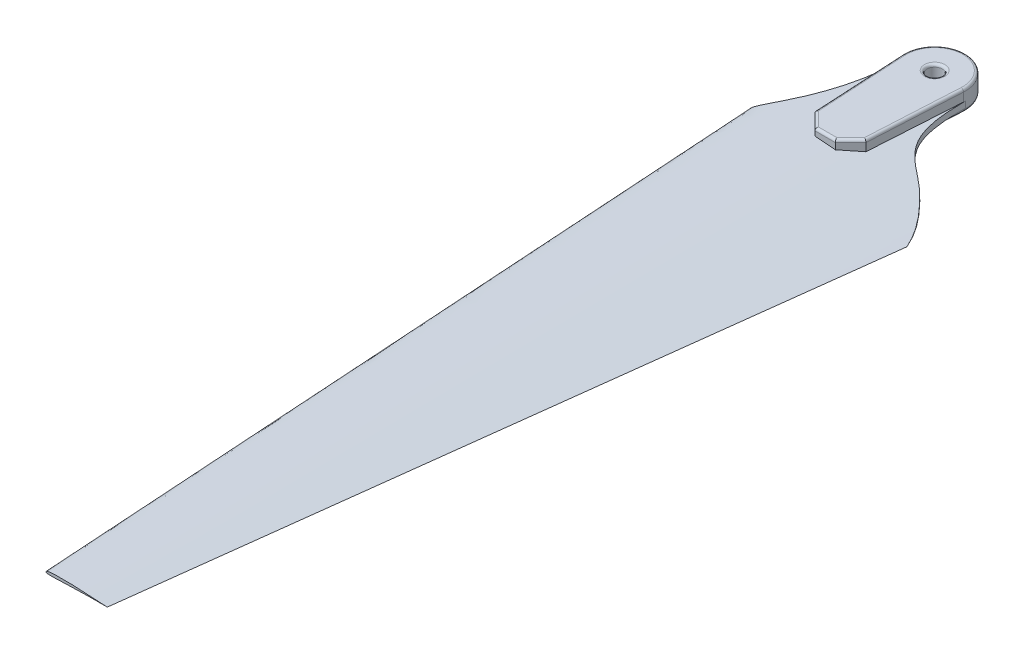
ISO-10303-21;
HEADER;
FILE_DESCRIPTION(('STEP AP214'),'2;1');
FILE_NAME('part.step','',(''),(''),'','','');
FILE_SCHEMA(('AUTOMOTIVE_DESIGN { 1 0 10303 214 1 1 1 1 }'));
ENDSEC;
DATA;
#1=APPLICATION_CONTEXT('core data for automotive mechanical design processes');
#2=APPLICATION_PROTOCOL_DEFINITION('international standard','automotive_design',2000,#1);
#3=PRODUCT_CONTEXT('',#1,'mechanical');
#4=PRODUCT('Part','Part','',(#3));
#5=PRODUCT_RELATED_PRODUCT_CATEGORY('part','',(#4));
#6=PRODUCT_DEFINITION_FORMATION('','',#4);
#7=PRODUCT_DEFINITION_CONTEXT('part definition',#1,'design');
#8=PRODUCT_DEFINITION('design','',#6,#7);
#9=PRODUCT_DEFINITION_SHAPE('','',#8);
#10=(LENGTH_UNIT() NAMED_UNIT(*) SI_UNIT(.MILLI.,.METRE.));
#11=(NAMED_UNIT(*) PLANE_ANGLE_UNIT() SI_UNIT($,.RADIAN.));
#12=(NAMED_UNIT(*) SI_UNIT($,.STERADIAN.) SOLID_ANGLE_UNIT());
#13=UNCERTAINTY_MEASURE_WITH_UNIT(LENGTH_MEASURE(1.E-05),#10,'distance_accuracy_value','');
#14=(GEOMETRIC_REPRESENTATION_CONTEXT(3) GLOBAL_UNCERTAINTY_ASSIGNED_CONTEXT((#13)) GLOBAL_UNIT_ASSIGNED_CONTEXT((#10,
#11,#12)) REPRESENTATION_CONTEXT('',''));
#15=CARTESIAN_POINT('',(0.,0.,0.));
#16=DIRECTION('',(0.,0.,1.));
#17=DIRECTION('',(1.,0.,0.));
#18=AXIS2_PLACEMENT_3D('',#15,#16,#17);
#19=CARTESIAN_POINT('',(-15.,0.,0.));
#20=CARTESIAN_POINT('',(-11.3333333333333,0.,56.6666666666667));
#21=CARTESIAN_POINT('',(-7.66666666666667,0.,113.333333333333));
#22=CARTESIAN_POINT('',(-4.,0.,170.));
#23=CARTESIAN_POINT('',(-15.0212451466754,-1.01864514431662,0.));
#24=CARTESIAN_POINT('',(-11.3513703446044,-0.859429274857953,56.6666666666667));
#25=CARTESIAN_POINT('',(-7.68149554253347,-0.700213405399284,113.333333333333));
#26=CARTESIAN_POINT('',(-4.01162074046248,-0.540997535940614,170.));
#27=CARTESIAN_POINT('',(-1.98738473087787,0.282275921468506,0.));
#28=CARTESIAN_POINT('',(-1.2152616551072,0.230377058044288,56.6666666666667));
#29=CARTESIAN_POINT('',(-0.443138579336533,0.178478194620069,113.333333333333));
#30=CARTESIAN_POINT('',(0.328984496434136,0.126579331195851,170.));
#31=CARTESIAN_POINT('',(25.,-3.51814008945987,0.));
#32=CARTESIAN_POINT('',(19.3333333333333,-2.34542672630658,56.6666666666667));
#33=CARTESIAN_POINT('',(13.6666666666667,-1.17271336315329,113.333333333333));
#34=CARTESIAN_POINT('',(8.,0.,170.));
#35=B_SPLINE_SURFACE_WITH_KNOTS('',3,3,((#19,#20,#21,#22),(#23,#24,#25,#26),(#27,#28,#29,#30),
(#31,#32,#33,#34)),.UNSPECIFIED.,.F.,.F.,.F.,(4,4),(4,4),(0.,1.),(0.,1.),.UNSPECIFIED.);
#36=CARTESIAN_POINT('',(22.2331836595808,-2.94554906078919,27.6681634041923));
#37=CARTESIAN_POINT('',(22.1695230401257,-2.93816895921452,27.5070539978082));
#38=CARTESIAN_POINT('',(22.1036491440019,-2.93050557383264,27.3468422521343));
#39=CARTESIAN_POINT('',(21.9675592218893,-2.91463173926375,27.0283064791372));
#40=CARTESIAN_POINT('',(21.8973433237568,-2.90642130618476,26.8699823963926));
#41=CARTESIAN_POINT('',(21.6807104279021,-2.88104568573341,26.3988512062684));
#42=CARTESIAN_POINT('',(21.5279491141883,-2.86309443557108,26.0889778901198));
#43=CARTESIAN_POINT('',(21.2066597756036,-2.82531507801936,25.4780918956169));
#44=CARTESIAN_POINT('',(21.0381486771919,-2.80548898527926,25.1770701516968));
#45=CARTESIAN_POINT('',(20.688913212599,-2.7644669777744,24.588045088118));
#46=CARTESIAN_POINT('',(20.5083942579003,-2.74329428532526,24.2999181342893));
#47=CARTESIAN_POINT('',(20.134293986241,-2.69956471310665,23.7321277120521));
#48=CARTESIAN_POINT('',(19.9407040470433,-2.67700692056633,23.4524700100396));
#49=CARTESIAN_POINT('',(19.5418871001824,-2.63075993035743,22.9014026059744));
#50=CARTESIAN_POINT('',(19.3366520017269,-2.60706994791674,22.6299988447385));
#51=CARTESIAN_POINT('',(18.9009976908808,-2.5570892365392,22.0758305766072));
#52=CARTESIAN_POINT('',(18.6698301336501,-2.53073424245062,21.7936611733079));
#53=CARTESIAN_POINT('',(18.3159053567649,-2.49069797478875,21.3765826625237));
#54=CARTESIAN_POINT('',(18.1967316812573,-2.4772682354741,21.2385822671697));
#55=CARTESIAN_POINT('',(17.9562266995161,-2.45027809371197,20.9644838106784));
#56=CARTESIAN_POINT('',(17.8348953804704,-2.43671769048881,20.8283857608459));
#57=CARTESIAN_POINT('',(17.5903475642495,-2.4095072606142,20.5579617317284));
#58=CARTESIAN_POINT('',(17.4671314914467,-2.39585725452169,20.4236353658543));
#59=CARTESIAN_POINT('',(17.2190218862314,-2.36850018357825,20.1565468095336));
#60=CARTESIAN_POINT('',(17.0941283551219,-2.35479311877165,20.0237846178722));
#61=CARTESIAN_POINT('',(16.842560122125,-2.32731394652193,19.7601413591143));
#62=CARTESIAN_POINT('',(16.7158867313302,-2.31354189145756,19.6292590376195));
#63=CARTESIAN_POINT('',(16.4605263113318,-2.2859121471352,19.3694860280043));
#64=CARTESIAN_POINT('',(16.3318392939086,-2.27205445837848,19.2405953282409));
#65=CARTESIAN_POINT('',(15.9396238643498,-2.23002557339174,18.8543001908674));
#66=CARTESIAN_POINT('',(15.6727762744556,-2.20170854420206,18.600260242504));
#67=CARTESIAN_POINT('',(15.1299291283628,-2.14471184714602,18.1023340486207));
#68=CARTESIAN_POINT('',(14.8539321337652,-2.11603228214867,17.8584450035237));
#69=CARTESIAN_POINT('',(14.433181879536,-2.07280956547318,17.500528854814));
#70=CARTESIAN_POINT('',(14.2917827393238,-2.0583657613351,17.3825247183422));
#71=CARTESIAN_POINT('',(14.0068420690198,-2.02943174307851,17.1491384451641));
#72=CARTESIAN_POINT('',(13.8633005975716,-2.01494153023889,17.033756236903));
#73=CARTESIAN_POINT('',(13.4293813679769,-1.97140986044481,16.6915150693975));
#74=CARTESIAN_POINT('',(13.1358518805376,-1.94232209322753,16.4686832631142));
#75=CARTESIAN_POINT('',(12.7263414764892,-1.90233971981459,16.159524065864));
#76=CARTESIAN_POINT('',(12.6108591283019,-1.89113070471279,16.0725305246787));
#77=CARTESIAN_POINT('',(12.380101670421,-1.86886974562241,15.8982468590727));
#78=CARTESIAN_POINT('',(12.2648265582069,-1.85781779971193,15.8109567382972));
#79=CARTESIAN_POINT('',(12.0349564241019,-1.83592135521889,15.6355717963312));
#80=CARTESIAN_POINT('',(11.9203611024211,-1.82507675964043,15.547477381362));
#81=CARTESIAN_POINT('',(11.6923008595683,-1.80364154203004,15.3698037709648));
#82=CARTESIAN_POINT('',(11.5788359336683,-1.79305091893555,15.2802245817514));
#83=CARTESIAN_POINT('',(11.3532935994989,-1.772147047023,15.0992352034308));
#84=CARTESIAN_POINT('',(11.2412165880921,-1.76183387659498,15.0078245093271));
#85=CARTESIAN_POINT('',(11.0187693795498,-1.74151246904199,14.8229172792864));
#86=CARTESIAN_POINT('',(10.9083991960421,-1.73150423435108,14.7294207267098));
#87=CARTESIAN_POINT('',(10.5831254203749,-1.70222895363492,14.4477750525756));
#88=CARTESIAN_POINT('',(10.3711438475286,-1.68344136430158,14.2561576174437));
#89=CARTESIAN_POINT('',(9.95784247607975,-1.64737553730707,13.8614491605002));
#90=CARTESIAN_POINT('',(9.75652513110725,-1.63009764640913,13.6583555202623));
#91=CARTESIAN_POINT('',(9.36778875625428,-1.59728355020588,13.2392249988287));
#92=CARTESIAN_POINT('',(9.18036272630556,-1.58174646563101,13.0231947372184));
#93=CARTESIAN_POINT('',(8.85895958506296,-1.55557398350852,12.623258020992));
#94=CARTESIAN_POINT('',(8.72190342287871,-1.54458677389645,12.4418482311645));
#95=CARTESIAN_POINT('',(8.45947367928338,-1.52386921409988,12.0706869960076));
#96=CARTESIAN_POINT('',(8.33409974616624,-1.514138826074,11.8809358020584));
#97=CARTESIAN_POINT('',(8.09574692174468,-1.49594514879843,11.4938142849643));
#98=CARTESIAN_POINT('',(7.98276489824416,-1.48748153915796,11.2964459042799));
#99=CARTESIAN_POINT('',(7.76851285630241,-1.4717224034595,10.8935289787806));
#100=CARTESIAN_POINT('',(7.66733634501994,-1.46443604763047,10.6879304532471));
#101=CARTESIAN_POINT('',(7.47730572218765,-1.45103015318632,10.2710299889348));
#102=CARTESIAN_POINT('',(7.3884550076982,-1.44491093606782,10.0597264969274));
#103=CARTESIAN_POINT('',(7.22237930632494,-1.4337404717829,9.63258685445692));
#104=CARTESIAN_POINT('',(7.14515501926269,-1.42868928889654,9.41675043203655));
#105=CARTESIAN_POINT('',(6.9673390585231,-1.41737675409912,8.87851036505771));
#106=CARTESIAN_POINT('',(6.8729925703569,-1.4116745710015,8.55402986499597));
#107=CARTESIAN_POINT('',(6.7040458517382,-1.40198550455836,7.89978671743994));
#108=CARTESIAN_POINT('',(6.62946075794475,-1.39799993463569,7.57002022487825));
#109=CARTESIAN_POINT('',(6.49678625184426,-1.39142951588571,6.90680769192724));
#110=CARTESIAN_POINT('',(6.43871676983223,-1.38884635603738,6.57335770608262));
#111=CARTESIAN_POINT('',(6.33635079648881,-1.38482588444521,5.90432370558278));
#112=CARTESIAN_POINT('',(6.29205670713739,-1.38338877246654,5.56873932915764));
#113=CARTESIAN_POINT('',(6.21475557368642,-1.38144782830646,4.89507348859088));
#114=CARTESIAN_POINT('',(6.18178964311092,-1.38094736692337,4.55698738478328));
#115=CARTESIAN_POINT('',(6.12545269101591,-1.38072271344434,3.88036638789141));
#116=CARTESIAN_POINT('',(6.10207231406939,-1.3809977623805,3.54183225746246));
#117=CARTESIAN_POINT('',(6.06330553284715,-1.38219099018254,2.86443773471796));
#118=CARTESIAN_POINT('',(6.04791634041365,-1.38310894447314,2.52557749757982));
#119=CARTESIAN_POINT('',(6.02386052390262,-1.38548403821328,1.84763543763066));
#120=CARTESIAN_POINT('',(6.0151937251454,-1.38694116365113,1.5085536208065));
#121=CARTESIAN_POINT('',(6.00603249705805,-1.3895970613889,0.974216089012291));
#122=CARTESIAN_POINT('',(6.00363076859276,-1.39064306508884,0.778988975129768));
#123=CARTESIAN_POINT('',(6.00056306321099,-1.39287005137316,0.38917418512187));
#124=CARTESIAN_POINT('',(5.99989131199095,-1.39405057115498,0.19458655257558));
#125=CARTESIAN_POINT('',(6.00000000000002,-1.39529369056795,0.));
#126=B_SPLINE_CURVE_WITH_KNOTS('',3,(#36,#37,#38,#39,#40,#41,#42,#43,#44,#45,#46,#47,#48,#49,
#50,#51,#52,#53,#54,#55,#56,#57,#58,#59,#60,#61,#62,#63,#64,#65,#66,#67,#68,#69,#70,#71,#72,#73,
#74,#75,#76,#77,#78,#79,#80,#81,#82,#83,#84,#85,#86,#87,#88,#89,#90,#91,#92,#93,#94,#95,#96,#97,
#98,#99,#100,#101,#102,#103,#104,#105,#106,#107,#108,#109,#110,#111,#112,#113,#114,#115,#116,
#117,#118,#119,#120,#121,#122,#123,#124,#125),.UNSPECIFIED.,.F.,.F.,(4,2,2,2,2,2,2,2,2,2,2,2,2,
2,2,2,2,2,2,2,2,2,2,2,2,2,2,2,2,2,2,2,2,2,2,2,2,2,2,2,2,2,2,2,4),(0.,0.520129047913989,
1.04024278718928,2.07754430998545,3.11374357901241,4.13535059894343,5.15763823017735,
6.18064503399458,7.27753369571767,7.82600641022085,8.3744823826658,8.92283662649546,
9.47119044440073,10.019159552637,10.5671254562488,11.675442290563,12.7834514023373,
13.3376340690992,13.8918015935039,15.0007014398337,15.4357562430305,15.870805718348,
16.3056464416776,16.7404853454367,17.1754458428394,17.6104098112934,18.4691547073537,
19.3280963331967,20.186602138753,20.8690629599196,21.5515032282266,22.2337706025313,
22.9211199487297,23.608658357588,24.2962381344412,25.3093286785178,26.3231929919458,
27.3382756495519,28.353535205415,29.3724414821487,30.3903509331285,31.4079049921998,
32.4254326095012,33.0111599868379,33.5949297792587),.UNSPECIFIED.);
#127=CARTESIAN_POINT('',(22.2331836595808,-2.9455490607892,27.6681634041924));
#128=VERTEX_POINT('',#127);
#129=CARTESIAN_POINT('',(6.,-1.39529369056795,0.));
#130=VERTEX_POINT('',#129);
#131=EDGE_CURVE('E207',#128,#130,#126,.T.);
#132=DIRECTION('',(-0.0994826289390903,0.0205878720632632,0.994826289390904));
#133=VECTOR('',#132,1.);
#134=CARTESIAN_POINT('',(16.5,-1.75907004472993,85.));
#135=LINE('',#134,#133);
#136=CARTESIAN_POINT('',(8.00000000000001,0.,170.));
#137=VERTEX_POINT('',#136);
#138=EDGE_CURVE('E221',#128,#137,#135,.T.);
#139=CARTESIAN_POINT('',(-4.,0.,170.));
#140=CARTESIAN_POINT('',(-4.01162074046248,-0.540997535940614,170.));
#141=CARTESIAN_POINT('',(0.328984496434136,0.126579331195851,170.));
#142=CARTESIAN_POINT('',(8.,0.,170.));
#143=B_SPLINE_CURVE_WITH_KNOTS('',3,(#139,#140,#141,#142),.UNSPECIFIED.,.F.,.F.,(4,4),(0.,1.),.UNSPECIFIED.);
#144=CARTESIAN_POINT('',(-4.,0.,170.));
#145=VERTEX_POINT('',#144);
#146=EDGE_CURVE('E400',#145,#137,#143,.T.);
#147=DIRECTION('',(-0.0645708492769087,0.,-0.99791312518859));
#148=VECTOR('',#147,1.);
#149=CARTESIAN_POINT('',(-9.5,0.,85.));
#150=LINE('',#149,#148);
#151=CARTESIAN_POINT('',(-13.5455970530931,0.,22.4771364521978));
#152=VERTEX_POINT('',#151);
#153=EDGE_CURVE('E233',#145,#152,#150,.T.);
#154=CARTESIAN_POINT('',(-13.5455970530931,0.,22.4771364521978));
#155=CARTESIAN_POINT('',(-13.5457006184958,-0.00468537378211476,22.4772692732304));
#156=CARTESIAN_POINT('',(-13.5455156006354,-0.00937715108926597,22.4770319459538));
#157=CARTESIAN_POINT('',(-13.5446209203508,-0.0185716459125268,22.4758840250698));
#158=CARTESIAN_POINT('',(-13.543917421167,-0.0230759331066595,22.4749813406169));
#159=CARTESIAN_POINT('',(-13.5420402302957,-0.0318018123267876,22.4725722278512));
#160=CARTESIAN_POINT('',(-13.5408674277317,-0.0360239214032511,22.4710669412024));
#161=CARTESIAN_POINT('',(-13.5381489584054,-0.0441436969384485,22.4675769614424));
#162=CARTESIAN_POINT('',(-13.5366022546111,-0.0480404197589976,22.4655909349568));
#163=CARTESIAN_POINT('',(-13.5320019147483,-0.0582154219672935,22.4596822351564));
#164=CARTESIAN_POINT('',(-13.5286718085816,-0.064158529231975,22.4554033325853));
#165=CARTESIAN_POINT('',(-13.5215264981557,-0.0752052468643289,22.446216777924));
#166=CARTESIAN_POINT('',(-13.5177096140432,-0.0803058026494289,22.4413069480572));
#167=CARTESIAN_POINT('',(-13.5080402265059,-0.0919572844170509,22.4288608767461));
#168=CARTESIAN_POINT('',(-13.5020320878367,-0.0981564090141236,22.4211209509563));
#169=CARTESIAN_POINT('',(-13.4896922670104,-0.109619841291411,22.4052087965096));
#170=CARTESIAN_POINT('',(-13.4833598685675,-0.114881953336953,22.3970356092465));
#171=CARTESIAN_POINT('',(-13.4704724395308,-0.124745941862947,22.3803852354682));
#172=CARTESIAN_POINT('',(-13.4639163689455,-0.129343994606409,22.3719066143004));
#173=CARTESIAN_POINT('',(-13.4506934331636,-0.138007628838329,22.3547885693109));
#174=CARTESIAN_POINT('',(-13.444026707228,-0.142073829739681,22.3461493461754));
#175=CARTESIAN_POINT('',(-13.4224004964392,-0.1545364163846,22.3180954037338));
#176=CARTESIAN_POINT('',(-13.4072876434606,-0.162134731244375,22.2984462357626));
#177=CARTESIAN_POINT('',(-13.3768889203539,-0.176062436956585,22.2588294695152));
#178=CARTESIAN_POINT('',(-13.3616029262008,-0.182390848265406,22.2388616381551));
#179=CARTESIAN_POINT('',(-13.3155601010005,-0.200080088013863,22.1785729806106));
#180=CARTESIAN_POINT('',(-13.2846861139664,-0.210110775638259,22.1379547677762));
#181=CARTESIAN_POINT('',(-13.2229193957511,-0.228154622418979,22.056298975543));
#182=CARTESIAN_POINT('',(-13.1920266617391,-0.236167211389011,22.0152612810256));
#183=CARTESIAN_POINT('',(-13.1303641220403,-0.250816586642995,21.9329491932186));
#184=CARTESIAN_POINT('',(-13.0995942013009,-0.25745542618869,21.8916752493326));
#185=CARTESIAN_POINT('',(-13.008028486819,-0.275832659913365,21.7682489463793));
#186=CARTESIAN_POINT('',(-12.9474188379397,-0.286176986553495,21.6857546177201));
#187=CARTESIAN_POINT('',(-12.8268516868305,-0.304676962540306,21.5200404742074));
#188=CARTESIAN_POINT('',(-12.7668942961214,-0.312832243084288,21.4368205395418));
#189=CARTESIAN_POINT('',(-12.6476389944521,-0.32767833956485,21.2696565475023));
#190=CARTESIAN_POINT('',(-12.588341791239,-0.334367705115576,21.1857118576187));
#191=CARTESIAN_POINT('',(-12.470504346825,-0.346700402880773,21.0172277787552));
#192=CARTESIAN_POINT('',(-12.4119640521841,-0.35234380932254,20.9326884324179));
#193=CARTESIAN_POINT('',(-12.2377272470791,-0.368106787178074,20.6785368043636));
#194=CARTESIAN_POINT('',(-12.1231810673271,-0.377085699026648,20.5080632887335));
#195=CARTESIAN_POINT('',(-11.8972977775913,-0.393224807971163,20.1650151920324));
#196=CARTESIAN_POINT('',(-11.7859595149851,-0.400385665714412,19.9924413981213));
#197=CARTESIAN_POINT('',(-11.5285117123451,-0.415794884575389,19.5851131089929));
#198=CARTESIAN_POINT('',(-11.383707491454,-0.423561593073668,19.3495136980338));
#199=CARTESIAN_POINT('',(-11.1000130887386,-0.437808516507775,18.8747310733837));
#200=CARTESIAN_POINT('',(-10.9611232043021,-0.444288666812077,18.6355476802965));
#201=CARTESIAN_POINT('',(-10.6892362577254,-0.456422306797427,18.1536283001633));
#202=CARTESIAN_POINT('',(-10.5562430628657,-0.462075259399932,17.9108901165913));
#203=CARTESIAN_POINT('',(-10.2962847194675,-0.472823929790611,17.4221918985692));
#204=CARTESIAN_POINT('',(-10.1693197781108,-0.477919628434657,17.1762317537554));
#205=CARTESIAN_POINT('',(-9.79747472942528,-0.49263972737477,16.4337206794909));
#206=CARTESIAN_POINT('',(-9.56166652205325,-0.50169620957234,15.9325783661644));
#207=CARTESIAN_POINT('',(-9.11339386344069,-0.519027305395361,14.9175860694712));
#208=CARTESIAN_POINT('',(-8.90102667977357,-0.527298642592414,14.4036932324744));
#209=CARTESIAN_POINT('',(-8.50049126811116,-0.543267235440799,13.3666718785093));
#210=CARTESIAN_POINT('',(-8.31231855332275,-0.550964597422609,12.843545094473));
#211=CARTESIAN_POINT('',(-7.95968121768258,-0.565868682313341,11.7894257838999));
#212=CARTESIAN_POINT('',(-7.79521408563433,-0.57307545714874,11.258434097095));
#213=CARTESIAN_POINT('',(-7.51711850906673,-0.585733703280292,10.2869618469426));
#214=CARTESIAN_POINT('',(-7.39968249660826,-0.591266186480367,9.84756555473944));
#215=CARTESIAN_POINT('',(-7.1798096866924,-0.60198735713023,8.96500142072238));
#216=CARTESIAN_POINT('',(-7.07737391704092,-0.607176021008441,8.52183332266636));
#217=CARTESIAN_POINT('',(-6.8870270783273,-0.617189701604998,7.63229792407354));
#218=CARTESIAN_POINT('',(-6.7991189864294,-0.622014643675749,7.18592998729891));
#219=CARTESIAN_POINT('',(-6.63733282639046,-0.631280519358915,6.2905624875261));
#220=CARTESIAN_POINT('',(-6.56345774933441,-0.635721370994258,5.84156238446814));
#221=CARTESIAN_POINT('',(-6.42972355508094,-0.644169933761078,4.94482393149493));
#222=CARTESIAN_POINT('',(-6.36976631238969,-0.648180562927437,4.49710019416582));
#223=CARTESIAN_POINT('',(-6.2626624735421,-0.655792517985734,3.6001860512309));
#224=CARTESIAN_POINT('',(-6.21551414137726,-0.659393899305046,3.15099585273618));
#225=CARTESIAN_POINT('',(-6.13350416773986,-0.666178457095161,2.25171267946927));
#226=CARTESIAN_POINT('',(-6.09863674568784,-0.669361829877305,1.8016202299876));
#227=CARTESIAN_POINT('',(-6.04065655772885,-0.675307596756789,0.901085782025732));
#228=CARTESIAN_POINT('',(-6.01753310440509,-0.678070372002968,0.450644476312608));
#229=CARTESIAN_POINT('',(-5.99999999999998,-0.680623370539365,0.));
#230=B_SPLINE_CURVE_WITH_KNOTS('',3,(#154,#155,#156,#157,#158,#159,#160,#161,#162,#163,#164,
#165,#166,#167,#168,#169,#170,#171,#172,#173,#174,#175,#176,#177,#178,#179,#180,#181,#182,#183,
#184,#185,#186,#187,#188,#189,#190,#191,#192,#193,#194,#195,#196,#197,#198,#199,#200,#201,#202,
#203,#204,#205,#206,#207,#208,#209,#210,#211,#212,#213,#214,#215,#216,#217,#218,#219,#220,#221,
#222,#223,#224,#225,#226,#227,#228,#229),.UNSPECIFIED.,.F.,.F.,(4,2,2,2,2,2,2,2,2,2,2,2,2,2,2,2,
2,2,2,2,2,2,2,2,2,2,2,2,2,2,2,2,2,2,2,2,2,4),(0.,0.0140281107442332,0.0278921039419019,
0.0417299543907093,0.0556066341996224,0.079601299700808,0.103681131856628,0.138375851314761,
0.173150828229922,0.208118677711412,0.243045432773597,0.320761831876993,0.398537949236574,
0.554437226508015,0.710380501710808,0.866088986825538,1.17470002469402,1.4833630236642,
1.79233005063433,2.10127514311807,2.71795559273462,3.33441163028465,4.16426654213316,
4.99416313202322,5.82459618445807,6.65505775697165,8.31611596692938,9.98382628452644,
11.6512268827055,13.3184507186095,14.68274795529,16.0471386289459,17.4118085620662,
18.7767690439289,20.1317921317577,21.4866314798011,22.8408322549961,24.1937984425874),.UNSPECIFIED.);
#231=CARTESIAN_POINT('',(-6.,-0.680623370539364,0.));
#232=VERTEX_POINT('',#231);
#233=EDGE_CURVE('E343',#152,#232,#230,.T.);
#234=CARTESIAN_POINT('',(-5.99105468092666,-0.679616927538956,0.327511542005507));
#235=CARTESIAN_POINT('',(-5.99403618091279,-0.679726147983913,0.272966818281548));
#236=CARTESIAN_POINT('',(-5.99627237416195,-0.679864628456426,0.21840182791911));
#237=CARTESIAN_POINT('',(-5.99925414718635,-0.680200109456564,0.109231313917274));
#238=CARTESIAN_POINT('',(-5.99999972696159,-0.680397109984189,0.0546257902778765));
#239=CARTESIAN_POINT('',(-5.99999999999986,-0.68062337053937,0.));
#240=B_SPLINE_CURVE_WITH_KNOTS('',3,(#234,#235,#236,#237,#238,#239),.UNSPECIFIED.,.F.,.F.,(4,2,
4),(0.,0.163832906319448,0.327665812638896),.UNSPECIFIED.);
#241=CARTESIAN_POINT('',(-5.99105468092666,-0.679616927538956,0.327511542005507));
#242=VERTEX_POINT('',#241);
#243=EDGE_CURVE('E309',#242,#232,#240,.T.);
#244=CARTESIAN_POINT('',(-4.99999999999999,-0.642310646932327,18.4565299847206));
#245=CARTESIAN_POINT('',(-5.16517576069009,-0.648701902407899,15.4350272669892));
#246=CARTESIAN_POINT('',(-5.33035153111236,-0.655006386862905,12.4135243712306));
#247=CARTESIAN_POINT('',(-5.66070309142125,-0.667441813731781,6.37051822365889));
#248=CARTESIAN_POINT('',(-5.82587888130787,-0.673572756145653,3.34901497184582));
#249=CARTESIAN_POINT('',(-5.99105468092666,-0.679616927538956,0.327511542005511));
#250=B_SPLINE_CURVE_WITH_KNOTS('',3,(#244,#245,#246,#247,#248,#249),.UNSPECIFIED.,.F.,.F.,(4,2,
4),(0.,9.07806272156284,18.1561254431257),.UNSPECIFIED.);
#251=CARTESIAN_POINT('',(-4.99999999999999,-0.642310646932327,18.4565299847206));
#252=VERTEX_POINT('',#251);
#253=EDGE_CURVE('E316',#252,#242,#250,.T.);
#254=CARTESIAN_POINT('',(-2.,-0.756052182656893,21.4565299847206));
#255=CARTESIAN_POINT('',(-2.24997749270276,-0.745416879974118,21.2065524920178));
#256=CARTESIAN_POINT('',(-2.49996143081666,-0.73508572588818,20.9565685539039));
#257=CARTESIAN_POINT('',(-2.99994046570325,-0.715010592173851,20.4565895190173));
#258=CARTESIAN_POINT('',(-3.24993556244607,-0.705266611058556,20.2065944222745));
#259=CARTESIAN_POINT('',(-3.74993643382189,-0.686344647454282,19.7065935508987));
#260=CARTESIAN_POINT('',(-3.99994220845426,-0.677166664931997,19.4565877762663));
#261=CARTESIAN_POINT('',(-4.49996392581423,-0.659345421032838,18.9565660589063));
#262=CARTESIAN_POINT('',(-4.74997986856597,-0.650702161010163,18.7065501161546));
#263=CARTESIAN_POINT('',(-4.99999999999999,-0.642310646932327,18.4565299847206));
#264=B_SPLINE_CURVE_WITH_KNOTS('',3,(#254,#255,#256,#257,#258,#259,#260,#261,#262,#263),
.UNSPECIFIED.,.F.,.F.,(4,2,2,2,4),(0.,1.06104432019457,2.12208595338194,3.18312752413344,
4.2441717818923),.UNSPECIFIED.);
#265=CARTESIAN_POINT('',(-2.,-0.756052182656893,21.4565299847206));
#266=VERTEX_POINT('',#265);
#267=EDGE_CURVE('E323',#266,#252,#264,.T.);
#268=CARTESIAN_POINT('',(2.,-0.976233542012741,21.4565299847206));
#269=CARTESIAN_POINT('',(1.33361270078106,-0.934461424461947,21.4565299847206));
#270=CARTESIAN_POINT('',(0.667085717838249,-0.895226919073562,21.4565299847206));
#271=CARTESIAN_POINT('',(-0.666247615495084,-0.821833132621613,21.4565299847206));
#272=CARTESIAN_POINT('',(-1.33305396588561,-0.787673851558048,21.4565299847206));
#273=CARTESIAN_POINT('',(-1.99999999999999,-0.756052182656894,21.4565299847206));
#274=B_SPLINE_CURVE_WITH_KNOTS('',3,(#268,#269,#270,#271,#272,#273),.UNSPECIFIED.,.F.,.F.,(4,2,
4),(0.,2.00304220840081,4.00608441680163),.UNSPECIFIED.);
#275=CARTESIAN_POINT('',(2.,-0.976233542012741,21.4565299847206));
#276=VERTEX_POINT('',#275);
#277=EDGE_CURVE('E330',#276,#266,#274,.T.);
#278=CARTESIAN_POINT('',(4.99999999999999,-1.2005709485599,18.4565299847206));
#279=CARTESIAN_POINT('',(4.50011581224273,-1.16008393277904,18.9564141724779));
#280=CARTESIAN_POINT('',(4.00017371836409,-1.12114564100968,19.4563562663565));
#281=CARTESIAN_POINT('',(3.0001737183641,-1.04636650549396,20.4563562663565));
#282=CARTESIAN_POINT('',(2.50011581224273,-1.0105256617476,20.9564141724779));
#283=CARTESIAN_POINT('',(2.00000000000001,-0.976233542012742,21.4565299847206));
#284=B_SPLINE_CURVE_WITH_KNOTS('',3,(#278,#279,#280,#281,#282,#283),.UNSPECIFIED.,.F.,.F.,(4,2,
4),(0.,2.12428893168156,4.24857786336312),.UNSPECIFIED.);
#285=CARTESIAN_POINT('',(4.99999999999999,-1.2005709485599,18.4565299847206));
#286=VERTEX_POINT('',#285);
#287=EDGE_CURVE('E336',#286,#276,#284,.T.);
#288=CARTESIAN_POINT('',(5.99105468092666,-1.39249448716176,0.327511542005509));
#289=CARTESIAN_POINT('',(5.82587919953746,-1.3599894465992,3.34900915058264));
#290=CARTESIAN_POINT('',(5.66070356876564,-1.3277432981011,6.37050949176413));
#291=CARTESIAN_POINT('',(5.33035200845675,-1.26376878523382,12.4135156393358));
#292=CARTESIAN_POINT('',(5.16517607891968,-1.23204042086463,15.435021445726));
#293=CARTESIAN_POINT('',(4.99999999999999,-1.2005709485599,18.4565299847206));
#294=B_SPLINE_CURVE_WITH_KNOTS('',3,(#288,#289,#290,#291,#292,#293),.UNSPECIFIED.,.F.,.F.,(4,2,
4),(0.,9.07855076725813,18.1571015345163),.UNSPECIFIED.);
#295=CARTESIAN_POINT('',(5.99105468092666,-1.39249448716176,0.327511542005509));
#296=VERTEX_POINT('',#295);
#297=EDGE_CURVE('E299',#296,#286,#294,.T.);
#298=CARTESIAN_POINT('',(6.,-1.39529369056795,0.));
#299=CARTESIAN_POINT('',(5.99999969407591,-1.39494709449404,0.0546269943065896));
#300=CARTESIAN_POINT('',(5.99925409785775,-1.39454052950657,0.109233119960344));
#301=CARTESIAN_POINT('',(5.9962723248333,-1.3936074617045,0.21840363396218));
#302=CARTESIAN_POINT('',(5.99403614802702,-1.39308095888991,0.272968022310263));
#303=CARTESIAN_POINT('',(5.99105468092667,-1.39249448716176,0.32751154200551));
#304=B_SPLINE_CURVE_WITH_KNOTS('',3,(#298,#299,#300,#301,#302,#303),.UNSPECIFIED.,.F.,.F.,(4,2,
4),(0.,0.163838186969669,0.327676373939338),.UNSPECIFIED.);
#305=EDGE_CURVE('E212',#130,#296,#304,.T.);
#306=ORIENTED_EDGE('',*,*,#131,.F.);
#307=ORIENTED_EDGE('',*,*,#138,.T.);
#308=ORIENTED_EDGE('',*,*,#146,.F.);
#309=ORIENTED_EDGE('',*,*,#153,.T.);
#310=ORIENTED_EDGE('',*,*,#233,.T.);
#311=ORIENTED_EDGE('',*,*,#243,.F.);
#312=ORIENTED_EDGE('',*,*,#253,.F.);
#313=ORIENTED_EDGE('',*,*,#267,.F.);
#314=ORIENTED_EDGE('',*,*,#277,.F.);
#315=ORIENTED_EDGE('',*,*,#287,.F.);
#316=ORIENTED_EDGE('',*,*,#297,.F.);
#317=ORIENTED_EDGE('',*,*,#305,.F.);
#318=EDGE_LOOP('',(#306,#307,#308,#309,#310,#311,#312,#313,#314,#315,#316,#317));
#319=FACE_BOUND('',#318,.T.);
#320=ADVANCED_FACE('F50',(#319),#35,.T.);
#321=CARTESIAN_POINT('',(25.0000000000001,-3.51814008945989,0.));
#322=CARTESIAN_POINT('',(19.3333333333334,-2.34542672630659,56.6666666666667));
#323=CARTESIAN_POINT('',(13.6666666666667,-1.17271336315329,113.333333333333));
#324=CARTESIAN_POINT('',(8.00000000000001,0.,170.));
#325=CARTESIAN_POINT('',(-2.2230220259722,2.32617677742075,0.));
#326=CARTESIAN_POINT('',(-1.47826142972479,1.7327713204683,56.6666666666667));
#327=CARTESIAN_POINT('',(-0.733500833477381,1.13936586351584,113.333333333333));
#328=CARTESIAN_POINT('',(0.0112597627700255,0.545960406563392,170.));
#329=CARTESIAN_POINT('',(-15.002862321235,1.03121592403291,0.));
#330=CARTESIAN_POINT('',(-11.3314882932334,0.869464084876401,56.6666666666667));
#331=CARTESIAN_POINT('',(-7.66011426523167,0.707712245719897,113.333333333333));
#332=CARTESIAN_POINT('',(-3.98874023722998,0.545960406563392,170.));
#333=CARTESIAN_POINT('',(-15.,0.,0.));
#334=CARTESIAN_POINT('',(-11.3333333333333,0.,56.6666666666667));
#335=CARTESIAN_POINT('',(-7.66666666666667,0.,113.333333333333));
#336=CARTESIAN_POINT('',(-4.,0.,170.));
#337=B_SPLINE_SURFACE_WITH_KNOTS('',3,3,((#321,#322,#323,#324),(#325,#326,#327,#328),(#329,#330,
#331,#332),(#333,#334,#335,#336)),.UNSPECIFIED.,.F.,.F.,.F.,(4,4),(4,4),(0.,1.),(0.,1.),.UNSPECIFIED.);
#338=CARTESIAN_POINT('',(6.,-0.19015164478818,0.));
#339=CARTESIAN_POINT('',(5.99984692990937,-0.190048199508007,0.303324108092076));
#340=CARTESIAN_POINT('',(6.00156381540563,-0.190184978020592,0.606659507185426));
#341=CARTESIAN_POINT('',(6.00940926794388,-0.191026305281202,1.21415986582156));
#342=CARTESIAN_POINT('',(6.01555074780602,-0.191732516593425,1.51832465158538));
#343=CARTESIAN_POINT('',(6.03294076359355,-0.193803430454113,2.12703413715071));
#344=CARTESIAN_POINT('',(6.04419804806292,-0.195169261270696,2.4315785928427));
#345=CARTESIAN_POINT('',(6.0726751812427,-0.19867289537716,3.04058620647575));
#346=CARTESIAN_POINT('',(6.08989886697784,-0.200811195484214,3.345049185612));
#347=CARTESIAN_POINT('',(6.1324656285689,-0.206139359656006,3.97033736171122));
#348=CARTESIAN_POINT('',(6.15820524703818,-0.209380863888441,4.29113572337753));
#349=CARTESIAN_POINT('',(6.21888428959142,-0.217072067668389,4.93163997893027));
#350=CARTESIAN_POINT('',(6.25381735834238,-0.221520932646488,5.25134647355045));
#351=CARTESIAN_POINT('',(6.33463373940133,-0.23187262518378,5.88910741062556));
#352=CARTESIAN_POINT('',(6.38050819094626,-0.237774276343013,6.20716297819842));
#353=CARTESIAN_POINT('',(6.48535048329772,-0.251339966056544,6.84103315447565));
#354=CARTESIAN_POINT('',(6.54431497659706,-0.259003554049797,7.15684831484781));
#355=CARTESIAN_POINT('',(6.66121830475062,-0.274292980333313,7.70680937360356));
#356=CARTESIAN_POINT('',(6.71574931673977,-0.28145208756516,7.94169043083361));
#357=CARTESIAN_POINT('',(6.834805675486,-0.297160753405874,8.40888476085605));
#358=CARTESIAN_POINT('',(6.89933112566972,-0.30571032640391,8.641198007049));
#359=CARTESIAN_POINT('',(7.03960256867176,-0.324398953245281,9.10238131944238));
#360=CARTESIAN_POINT('',(7.11534896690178,-0.334538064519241,9.33125126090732));
#361=CARTESIAN_POINT('',(7.27759573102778,-0.356388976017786,9.77992830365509));
#362=CARTESIAN_POINT('',(7.36385132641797,-0.368065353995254,9.99982511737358));
#363=CARTESIAN_POINT('',(7.54917031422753,-0.393318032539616,10.4340698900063));
#364=CARTESIAN_POINT('',(7.64823389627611,-0.406894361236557,10.6484177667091));
#365=CARTESIAN_POINT('',(7.85970957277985,-0.436086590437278,11.0702750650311));
#366=CARTESIAN_POINT('',(7.97211981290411,-0.451702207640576,11.2777854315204));
#367=CARTESIAN_POINT('',(8.18138016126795,-0.480999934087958,11.6353923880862));
#368=CARTESIAN_POINT('',(8.27538405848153,-0.494231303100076,11.787198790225));
#369=CARTESIAN_POINT('',(8.47084758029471,-0.521912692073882,12.0858698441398));
#370=CARTESIAN_POINT('',(8.57230880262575,-0.536362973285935,12.232733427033));
#371=CARTESIAN_POINT('',(8.78224874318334,-0.566454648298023,12.5212125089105));
#372=CARTESIAN_POINT('',(8.89072717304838,-0.582095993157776,12.6628282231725));
#373=CARTESIAN_POINT('',(9.1140681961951,-0.614512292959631,12.9406607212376));
#374=CARTESIAN_POINT('',(9.2289273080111,-0.631286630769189,13.0768803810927));
#375=CARTESIAN_POINT('',(9.46627171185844,-0.666183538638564,13.3462283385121));
#376=CARTESIAN_POINT('',(9.58884932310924,-0.684323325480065,13.4792728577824));
#377=CARTESIAN_POINT('',(9.83915964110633,-0.721624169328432,13.740251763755));
#378=CARTESIAN_POINT('',(9.96689226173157,-0.740785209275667,13.8681862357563));
#379=CARTESIAN_POINT('',(10.2267935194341,-0.780046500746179,14.1194251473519));
#380=CARTESIAN_POINT('',(10.3589641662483,-0.800147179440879,14.2427274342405));
#381=CARTESIAN_POINT('',(10.6270000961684,-0.841196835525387,14.4852091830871));
#382=CARTESIAN_POINT('',(10.7628669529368,-0.862146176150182,14.6043868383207));
#383=CARTESIAN_POINT('',(11.0292484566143,-0.903506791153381,14.8320193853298));
#384=CARTESIAN_POINT('',(11.1595891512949,-0.923873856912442,14.940686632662));
#385=CARTESIAN_POINT('',(11.4223806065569,-0.965204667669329,15.1553246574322));
#386=CARTESIAN_POINT('',(11.5548314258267,-0.986168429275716,15.2612953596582));
#387=CARTESIAN_POINT('',(11.8214730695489,-1.02864267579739,15.4709888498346));
#388=CARTESIAN_POINT('',(11.9556644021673,-1.05015332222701,15.5747109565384));
#389=CARTESIAN_POINT('',(12.2250042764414,-1.0936008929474,15.7808082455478));
#390=CARTESIAN_POINT('',(12.3601528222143,-1.11553781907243,15.8831834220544));
#391=CARTESIAN_POINT('',(12.6307140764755,-1.1597257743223,16.0875230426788));
#392=CARTESIAN_POINT('',(12.766126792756,-1.18197681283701,16.1894874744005));
#393=CARTESIAN_POINT('',(13.0365854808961,-1.22668590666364,16.3938558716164));
#394=CARTESIAN_POINT('',(13.1716314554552,-1.24914396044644,16.4962598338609));
#395=CARTESIAN_POINT('',(13.4405729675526,-1.2941295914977,16.7023546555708));
#396=CARTESIAN_POINT('',(13.5744692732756,-1.31665710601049,16.8060445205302));
#397=CARTESIAN_POINT('',(13.840495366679,-1.36166630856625,17.0156774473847));
#398=CARTESIAN_POINT('',(13.972625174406,-1.38414799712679,17.1216204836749));
#399=CARTESIAN_POINT('',(14.2350330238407,-1.42903849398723,17.3356888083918));
#400=CARTESIAN_POINT('',(14.3653117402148,-1.45144732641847,17.4438132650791));
#401=CARTESIAN_POINT('',(14.6239954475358,-1.49617600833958,17.6623036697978));
#402=CARTESIAN_POINT('',(14.75240040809,-1.51849585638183,17.7726696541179));
#403=CARTESIAN_POINT('',(15.0073731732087,-1.56304086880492,17.9956815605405));
#404=CARTESIAN_POINT('',(15.1339398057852,-1.58526596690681,18.1083288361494));
#405=CARTESIAN_POINT('',(15.3851372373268,-1.62959266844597,18.3357803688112));
#406=CARTESIAN_POINT('',(15.5097680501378,-1.65169427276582,18.4505846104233));
#407=CARTESIAN_POINT('',(15.8753722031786,-1.71683688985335,18.7930639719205));
#408=CARTESIAN_POINT('',(16.1136287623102,-1.75969029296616,19.0236887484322));
#409=CARTESIAN_POINT('',(16.4660551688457,-1.82363009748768,19.3751459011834));
#410=CARTESIAN_POINT('',(16.5828302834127,-1.84490993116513,19.4933517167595));
#411=CARTESIAN_POINT('',(16.8147445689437,-1.88735112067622,19.7313817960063));
#412=CARTESIAN_POINT('',(16.9298837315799,-1.90851247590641,19.8512060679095));
#413=CARTESIAN_POINT('',(17.1588157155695,-1.95076163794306,20.0924804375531));
#414=CARTESIAN_POINT('',(17.2726063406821,-1.9718492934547,20.2139326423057));
#415=CARTESIAN_POINT('',(17.498789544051,-2.01393457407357,20.4581476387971));
#416=CARTESIAN_POINT('',(17.6111821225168,-2.03493219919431,20.5809104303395));
#417=CARTESIAN_POINT('',(17.8344234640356,-2.07680256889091,20.8279631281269));
#418=CARTESIAN_POINT('',(17.9452714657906,-2.0976752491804,20.9522537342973));
#419=CARTESIAN_POINT('',(18.1651898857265,-2.13924346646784,21.2024244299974));
#420=CARTESIAN_POINT('',(18.2742603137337,-2.15993900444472,21.3283045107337));
#421=CARTESIAN_POINT('',(18.5984684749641,-2.22168285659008,21.7084333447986));
#422=CARTESIAN_POINT('',(18.8106762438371,-2.26240214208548,21.9652512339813));
#423=CARTESIAN_POINT('',(19.2256865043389,-2.34258138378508,22.4863295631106));
#424=CARTESIAN_POINT('',(19.4284947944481,-2.38204211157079,22.7505852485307));
#425=CARTESIAN_POINT('',(19.7559496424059,-2.44615890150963,23.1955379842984));
#426=CARTESIAN_POINT('',(19.883629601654,-2.47126737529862,23.3739411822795));
#427=CARTESIAN_POINT('',(20.1338238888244,-2.5206640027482,23.7341662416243));
#428=CARTESIAN_POINT('',(20.2563435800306,-2.54495300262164,23.9159842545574));
#429=CARTESIAN_POINT('',(20.4958713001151,-2.59261622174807,24.2831087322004));
#430=CARTESIAN_POINT('',(20.6128840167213,-2.61599121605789,24.4684120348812));
#431=CARTESIAN_POINT('',(20.8410859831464,-2.6617381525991,24.8425572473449));
#432=CARTESIAN_POINT('',(20.9522783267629,-2.68411062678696,25.0313972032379));
#433=CARTESIAN_POINT('',(21.1717235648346,-2.7284091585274,25.4182242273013));
#434=CARTESIAN_POINT('',(21.2797960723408,-2.75030315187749,25.6163174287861));
#435=CARTESIAN_POINT('',(21.4892238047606,-2.79286320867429,26.0163296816));
#436=CARTESIAN_POINT('',(21.5905743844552,-2.81352842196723,26.2182512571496));
#437=CARTESIAN_POINT('',(21.7863401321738,-2.85355986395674,26.6259607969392));
#438=CARTESIAN_POINT('',(21.8807438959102,-2.87292395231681,26.8317544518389));
#439=CARTESIAN_POINT('',(22.062442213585,-2.91029244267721,27.2472235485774));
#440=CARTESIAN_POINT('',(22.1497175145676,-2.92829315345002,27.4569077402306));
#441=CARTESIAN_POINT('',(22.2331836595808,-2.9455490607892,27.6681634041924));
#442=B_SPLINE_CURVE_WITH_KNOTS('',3,(#338,#339,#340,#341,#342,#343,#344,#345,#346,#347,#348,
#349,#350,#351,#352,#353,#354,#355,#356,#357,#358,#359,#360,#361,#362,#363,#364,#365,#366,#367,
#368,#369,#370,#371,#372,#373,#374,#375,#376,#377,#378,#379,#380,#381,#382,#383,#384,#385,#386,
#387,#388,#389,#390,#391,#392,#393,#394,#395,#396,#397,#398,#399,#400,#401,#402,#403,#404,#405,
#406,#407,#408,#409,#410,#411,#412,#413,#414,#415,#416,#417,#418,#419,#420,#421,#422,#423,#424,
#425,#426,#427,#428,#429,#430,#431,#432,#433,#434,#435,#436,#437,#438,#439,#440,#441),
.UNSPECIFIED.,.F.,.F.,(4,2,2,2,2,2,2,2,2,2,2,2,2,2,2,2,2,2,2,2,2,2,2,2,2,2,2,2,2,2,2,2,2,2,2,2,
2,2,2,2,2,2,2,2,2,2,2,2,2,2,2,4),(0.,0.909981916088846,1.82263035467,2.73684542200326,
3.65164952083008,4.6170734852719,5.58183180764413,6.54581146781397,7.50954489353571,
8.23305872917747,8.95658005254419,9.68012752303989,10.3892359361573,11.0983548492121,
11.8073753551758,12.3442925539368,12.8813251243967,13.4183356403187,13.9550559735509,
14.5003237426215,15.0455824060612,15.5910914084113,16.1368364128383,16.6495414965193,
17.1622608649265,17.6751334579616,18.1880082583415,18.7008984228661,19.2137848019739,
19.7262965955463,20.2388025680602,20.7511166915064,21.2634391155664,21.7760749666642,
22.2887071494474,23.2915655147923,23.7941044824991,24.2966460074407,24.7999168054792,
25.3031875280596,25.8066981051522,26.3102058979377,27.3168925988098,28.3229497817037,
28.9853239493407,29.6469917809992,30.3080857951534,30.9688247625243,31.6488396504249,
32.3293196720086,33.0108929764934,33.6942501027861),.UNSPECIFIED.);
#443=CARTESIAN_POINT('',(6.,-0.19015164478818,0.));
#444=VERTEX_POINT('',#443);
#445=EDGE_CURVE('E205',#444,#128,#442,.T.);
#446=CARTESIAN_POINT('',(5.99105468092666,-0.188907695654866,0.32751154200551));
#447=CARTESIAN_POINT('',(5.99403615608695,-0.189307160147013,0.272967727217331));
#448=CARTESIAN_POINT('',(5.9962723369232,-0.189610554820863,0.218403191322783));
#449=CARTESIAN_POINT('',(5.99925410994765,-0.190025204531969,0.109232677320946));
#450=CARTESIAN_POINT('',(5.99999970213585,-0.190136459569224,0.0546266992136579));
#451=CARTESIAN_POINT('',(6.00000000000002,-0.190151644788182,0.));
#452=B_SPLINE_CURVE_WITH_KNOTS('',3,(#446,#447,#448,#449,#450,#451),.UNSPECIFIED.,.F.,.F.,(4,2,
4),(0.,0.163833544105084,0.327667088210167),.UNSPECIFIED.);
#453=CARTESIAN_POINT('',(5.99105468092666,-0.188907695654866,0.32751154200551));
#454=VERTEX_POINT('',#453);
#455=EDGE_CURVE('E218',#454,#444,#452,.T.);
#456=CARTESIAN_POINT('',(4.99999999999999,-0.0590791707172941,18.4565299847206));
#457=CARTESIAN_POINT('',(5.16517597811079,-0.0802100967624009,15.435023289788));
#458=CARTESIAN_POINT('',(5.33035185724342,-0.101594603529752,12.4135184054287));
#459=CARTESIAN_POINT('',(5.6607034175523,-0.144870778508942,6.37051225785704));
#460=CARTESIAN_POINT('',(5.82587909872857,-0.166762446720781,3.34901099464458));
#461=CARTESIAN_POINT('',(5.99105468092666,-0.188907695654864,0.32751154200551));
#462=B_SPLINE_CURVE_WITH_KNOTS('',3,(#456,#457,#458,#459,#460,#461),.UNSPECIFIED.,.F.,.F.,(4,2,
4),(0.,9.0782756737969,18.1565513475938),.UNSPECIFIED.);
#463=CARTESIAN_POINT('',(4.99999999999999,-0.0590791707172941,18.4565299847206));
#464=VERTEX_POINT('',#463);
#465=EDGE_CURVE('E229',#464,#454,#462,.T.);
#466=CARTESIAN_POINT('',(2.,0.277770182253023,21.4565299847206));
#467=CARTESIAN_POINT('',(2.16676488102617,0.260832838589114,21.2897651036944));
#468=CARTESIAN_POINT('',(2.33351382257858,0.24358231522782,21.123016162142));
#469=CARTESIAN_POINT('',(2.6669776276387,0.208472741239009,20.7895523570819));
#470=CARTESIAN_POINT('',(2.83369249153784,0.190613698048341,20.6228374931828));
#471=CARTESIAN_POINT('',(3.16708905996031,0.154304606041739,20.2894409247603));
#472=CARTESIAN_POINT('',(3.3337707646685,0.135854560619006,20.1227592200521));
#473=CARTESIAN_POINT('',(3.66710177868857,0.0983795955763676,19.789428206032));
#474=CARTESIAN_POINT('',(3.83375108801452,0.0793546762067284,19.6227788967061));
#475=CARTESIAN_POINT('',(4.16701831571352,0.0407452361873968,19.2895116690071));
#476=CARTESIAN_POINT('',(4.33363623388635,0.0211607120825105,19.1228937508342));
#477=CARTESIAN_POINT('',(4.66684152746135,-0.0185537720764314,18.7896884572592));
#478=CARTESIAN_POINT('',(4.83342890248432,-0.03868373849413,18.6231010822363));
#479=CARTESIAN_POINT('',(4.99999999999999,-0.0590791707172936,18.4565299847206));
#480=B_SPLINE_CURVE_WITH_KNOTS('',3,(#466,#467,#468,#469,#470,#471,#472,#473,#474,#475,#476,
#477,#478,#479),.UNSPECIFIED.,.F.,.F.,(4,2,2,2,2,2,4),(0.,0.709345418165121,1.41868217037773,
2.1280148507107,2.83734722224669,3.54668397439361,4.25602900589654),.UNSPECIFIED.);
#481=CARTESIAN_POINT('',(2.,0.277770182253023,21.4565299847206));
#482=VERTEX_POINT('',#481);
#483=EDGE_CURVE('E231',#482,#464,#480,.T.);
#484=CARTESIAN_POINT('',(-2.,0.620401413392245,21.4565299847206));
#485=CARTESIAN_POINT('',(-1.77746337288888,0.605163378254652,21.4565299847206));
#486=CARTESIAN_POINT('',(-1.55497449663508,0.589233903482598,21.4565299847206));
#487=CARTESIAN_POINT('',(-1.11010893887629,0.556054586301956,21.4565299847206));
#488=CARTESIAN_POINT('',(-0.887732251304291,0.538804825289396,21.4565299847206));
#489=CARTESIAN_POINT('',(-0.443086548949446,0.503046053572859,21.4565299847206));
#490=CARTESIAN_POINT('',(-0.220817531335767,0.484537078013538,21.4565299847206));
#491=CARTESIAN_POINT('',(0.223615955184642,0.44631309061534,21.4565299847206));
#492=CARTESIAN_POINT('',(0.445780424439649,0.42659808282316,21.4565299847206));
#493=CARTESIAN_POINT('',(0.890010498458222,0.386010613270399,21.4565299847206));
#494=CARTESIAN_POINT('',(1.112076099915,0.365138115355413,21.4565299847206));
#495=CARTESIAN_POINT('',(1.55611263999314,0.322278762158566,21.4565299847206));
#496=CARTESIAN_POINT('',(1.77808357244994,0.300291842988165,21.4565299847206));
#497=CARTESIAN_POINT('',(2.,0.277770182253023,21.4565299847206));
#498=B_SPLINE_CURVE_WITH_KNOTS('',3,(#484,#485,#486,#487,#488,#489,#490,#491,#492,#493,#494,
#495,#496,#497),.UNSPECIFIED.,.F.,.F.,(4,2,2,2,2,2,4),(0.,0.669171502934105,1.33830178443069,
2.00741339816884,2.6765227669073,3.34565304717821,4.01482173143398),.UNSPECIFIED.);
#499=CARTESIAN_POINT('',(-2.,0.620401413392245,21.4565299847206));
#500=VERTEX_POINT('',#499);
#501=EDGE_CURVE('E453',#500,#482,#498,.T.);
#502=CARTESIAN_POINT('',(-4.99999999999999,0.78448578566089,18.4565299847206));
#503=CARTESIAN_POINT('',(-4.83326599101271,0.777953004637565,18.6232639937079));
#504=CARTESIAN_POINT('',(-4.66654123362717,0.770953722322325,18.7899887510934));
#505=CARTESIAN_POINT('',(-4.33311594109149,0.756060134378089,19.1234140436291));
#506=CARTESIAN_POINT('',(-4.16641540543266,0.748165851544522,19.2901145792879));
#507=CARTESIAN_POINT('',(-3.83303772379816,0.73152000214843,19.6234922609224));
#508=CARTESIAN_POINT('',(-3.66636057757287,0.72276844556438,19.7901694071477));
#509=CARTESIAN_POINT('',(-3.33302917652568,0.704441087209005,20.1235008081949));
#510=CARTESIAN_POINT('',(-3.16637492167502,0.694865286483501,20.2901550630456));
#511=CARTESIAN_POINT('',(-2.83308804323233,0.674919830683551,20.6234419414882));
#512=CARTESIAN_POINT('',(-2.66645541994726,0.66455016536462,20.7900745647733));
#513=CARTESIAN_POINT('',(-2.33321091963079,0.643044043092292,21.1233190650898));
#514=CARTESIAN_POINT('',(-2.16659904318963,0.631907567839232,21.289930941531));
#515=CARTESIAN_POINT('',(-2.,0.620401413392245,21.4565299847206));
#516=B_SPLINE_CURVE_WITH_KNOTS('',3,(#502,#503,#504,#505,#506,#507,#508,#509,#510,#511,#512,
#513,#514,#515),.UNSPECIFIED.,.F.,.F.,(4,2,2,2,2,2,4),(0.,0.707663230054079,1.41530844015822,
2.12294541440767,2.83058149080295,3.53822670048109,4.24588880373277),.UNSPECIFIED.);
#517=CARTESIAN_POINT('',(-4.99999999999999,0.78448578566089,18.4565299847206));
#518=VERTEX_POINT('',#517);
#519=EDGE_CURVE('E569',#518,#500,#516,.T.);
#520=CARTESIAN_POINT('',(-5.99105468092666,0.848191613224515,0.327511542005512));
#521=CARTESIAN_POINT('',(-5.82587887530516,0.837706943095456,3.34901508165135));
#522=CARTESIAN_POINT('',(-5.66070308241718,0.82715578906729,6.37051838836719));
#523=CARTESIAN_POINT('',(-5.33035152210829,0.805920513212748,12.4135245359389));
#524=CARTESIAN_POINT('',(-5.16517575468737,0.795236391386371,15.4350273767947));
#525=CARTESIAN_POINT('',(-4.99999999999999,0.784485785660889,18.4565299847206));
#526=B_SPLINE_CURVE_WITH_KNOTS('',3,(#520,#521,#522,#523,#524,#525),.UNSPECIFIED.,.F.,.F.,(4,2,
4),(0.,9.0780994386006,18.1561988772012),.UNSPECIFIED.);
#527=CARTESIAN_POINT('',(-5.99105468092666,0.848191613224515,0.327511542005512));
#528=VERTEX_POINT('',#527);
#529=EDGE_CURVE('E433',#528,#518,#526,.T.);
#530=CARTESIAN_POINT('',(-6.,0.849031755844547,0.));
#531=CARTESIAN_POINT('',(-5.99999971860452,0.848940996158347,0.0546260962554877));
#532=CARTESIAN_POINT('',(-5.99925413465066,0.848825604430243,0.10923177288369));
#533=CARTESIAN_POINT('',(-5.99627236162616,0.848545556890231,0.218402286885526));
#534=CARTESIAN_POINT('',(-5.99403617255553,0.848380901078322,0.272967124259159));
#535=CARTESIAN_POINT('',(-5.99105468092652,0.848191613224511,0.327511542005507));
#536=B_SPLINE_CURVE_WITH_KNOTS('',3,(#530,#531,#532,#533,#534,#535),.UNSPECIFIED.,.F.,.F.,(4,2,
4),(0.,0.163832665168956,0.327665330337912),.UNSPECIFIED.);
#537=CARTESIAN_POINT('',(-5.99999999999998,0.849031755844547,0.));
#538=VERTEX_POINT('',#537);
#539=EDGE_CURVE('E271',#538,#528,#536,.T.);
#540=CARTESIAN_POINT('',(-5.99999999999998,0.849031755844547,0.));
#541=CARTESIAN_POINT('',(-6.01618550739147,0.848874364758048,0.416015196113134));
#542=CARTESIAN_POINT('',(-6.03713548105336,0.8488639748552,0.831856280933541));
#543=CARTESIAN_POINT('',(-6.08898083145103,0.849101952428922,1.66296217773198));
#544=CARTESIAN_POINT('',(-6.11987730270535,0.849350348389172,2.07822692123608));
#545=CARTESIAN_POINT('',(-6.19202863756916,0.850070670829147,2.9078592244));
#546=CARTESIAN_POINT('',(-6.23328347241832,0.850542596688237,3.32222678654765));
#547=CARTESIAN_POINT('',(-6.32699856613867,0.851658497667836,4.15355967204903));
#548=CARTESIAN_POINT('',(-6.37955848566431,0.852304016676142,4.57051379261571));
#549=CARTESIAN_POINT('',(-6.4960816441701,0.853686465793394,5.40283801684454));
#550=CARTESIAN_POINT('',(-6.56004507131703,0.854423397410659,5.8182080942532));
#551=CARTESIAN_POINT('',(-6.69980370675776,0.855882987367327,6.64702204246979));
#552=CARTESIAN_POINT('',(-6.77560082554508,0.856605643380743,7.06046559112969));
#553=CARTESIAN_POINT('',(-6.96267231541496,0.858084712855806,8.00191339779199));
#554=CARTESIAN_POINT('',(-7.07791068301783,0.858792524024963,8.52913719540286));
#555=CARTESIAN_POINT('',(-7.32938138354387,0.859576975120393,9.57870183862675));
#556=CARTESIAN_POINT('',(-7.46561896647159,0.859653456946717,10.1010414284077));
#557=CARTESIAN_POINT('',(-7.75981466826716,0.858648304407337,11.1396958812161));
#558=CARTESIAN_POINT('',(-7.91777716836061,0.857566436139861,11.656009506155));
#559=CARTESIAN_POINT('',(-8.25606426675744,0.853529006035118,12.6814871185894));
#560=CARTESIAN_POINT('',(-8.43639742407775,0.850572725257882,13.1906482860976));
#561=CARTESIAN_POINT('',(-8.81878278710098,0.841821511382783,14.1975976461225));
#562=CARTESIAN_POINT('',(-9.02071295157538,0.836041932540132,14.6954322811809));
#563=CARTESIAN_POINT('',(-9.4473289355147,0.820295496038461,15.6812015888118));
#564=CARTESIAN_POINT('',(-9.67201361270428,0.810328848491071,16.1691367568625));
#565=CARTESIAN_POINT('',(-10.0260071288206,0.790692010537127,16.8923692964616));
#566=CARTESIAN_POINT('',(-10.146795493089,0.783368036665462,17.1319340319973));
#567=CARTESIAN_POINT('',(-10.3940217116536,0.766782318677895,17.6080591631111));
#568=CARTESIAN_POINT('',(-10.5204593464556,0.757520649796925,17.8446196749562));
#569=CARTESIAN_POINT('',(-10.778820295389,0.736591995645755,18.3143376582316));
#570=CARTESIAN_POINT('',(-10.9107385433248,0.724927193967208,18.5474980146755));
#571=CARTESIAN_POINT('',(-11.1800859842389,0.69853230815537,19.0104250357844));
#572=CARTESIAN_POINT('',(-11.3175147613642,0.683802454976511,19.2401919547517));
#573=CARTESIAN_POINT('',(-11.5109401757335,0.66066898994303,19.5548602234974));
#574=CARTESIAN_POINT('',(-11.5646333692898,0.65400039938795,19.641312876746));
#575=CARTESIAN_POINT('',(-11.6727882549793,0.639997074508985,19.8136761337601));
#576=CARTESIAN_POINT('',(-11.7272499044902,0.632662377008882,19.899586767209));
#577=CARTESIAN_POINT('',(-11.8369300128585,0.617237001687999,20.0708485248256));
#578=CARTESIAN_POINT('',(-11.8921484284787,0.609146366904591,20.15619968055));
#579=CARTESIAN_POINT('',(-12.0033313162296,0.592093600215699,20.3263281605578));
#580=CARTESIAN_POINT('',(-12.059295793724,0.583131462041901,20.4111054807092));
#581=CARTESIAN_POINT('',(-12.1916467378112,0.560879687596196,20.6095980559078));
#582=CARTESIAN_POINT('',(-12.2683322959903,0.547172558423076,20.7230677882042));
#583=CARTESIAN_POINT('',(-12.4229662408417,0.517412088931,20.9488369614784));
#584=CARTESIAN_POINT('',(-12.5009146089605,0.501358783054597,21.0611364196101));
#585=CARTESIAN_POINT('',(-12.6324752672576,0.471812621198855,21.2481887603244));
#586=CARTESIAN_POINT('',(-12.6857745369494,0.459179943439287,21.323297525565));
#587=CARTESIAN_POINT('',(-12.7928422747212,0.432070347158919,21.4728493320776));
#588=CARTESIAN_POINT('',(-12.846610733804,0.417593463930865,21.5472923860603));
#589=CARTESIAN_POINT('',(-12.9370798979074,0.391226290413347,21.6714582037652));
#590=CARTESIAN_POINT('',(-12.9736817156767,0.380011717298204,21.7213961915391));
#591=CARTESIAN_POINT('',(-13.0469960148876,0.356115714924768,21.8208380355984));
#592=CARTESIAN_POINT('',(-13.083708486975,0.343434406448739,21.8703419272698));
#593=CARTESIAN_POINT('',(-13.1453684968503,0.320463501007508,21.9530046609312));
#594=CARTESIAN_POINT('',(-13.1703134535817,0.310711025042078,21.9863142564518));
#595=CARTESIAN_POINT('',(-13.2201500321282,0.290019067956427,22.0526027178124));
#596=CARTESIAN_POINT('',(-13.2450416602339,0.279079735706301,22.0855816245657));
#597=CARTESIAN_POINT('',(-13.2868076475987,0.259301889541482,22.1407045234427));
#598=CARTESIAN_POINT('',(-13.3037238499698,0.250895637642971,22.162971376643));
#599=CARTESIAN_POINT('',(-13.3374164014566,0.233106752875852,22.2072056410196));
#600=CARTESIAN_POINT('',(-13.3541928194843,0.223724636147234,22.2291732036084));
#601=CARTESIAN_POINT('',(-13.3823245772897,0.206745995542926,22.2659158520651));
#602=CARTESIAN_POINT('',(-13.3937437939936,0.199501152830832,22.2808037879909));
#603=CARTESIAN_POINT('',(-13.4163987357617,0.184187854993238,22.3102893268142));
#604=CARTESIAN_POINT('',(-13.4276345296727,0.17611971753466,22.3248870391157));
#605=CARTESIAN_POINT('',(-13.4494347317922,0.159148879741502,22.3531625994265));
#606=CARTESIAN_POINT('',(-13.4600090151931,0.150283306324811,22.3668548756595));
#607=CARTESIAN_POINT('',(-13.4806464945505,0.13108489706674,22.393535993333));
#608=CARTESIAN_POINT('',(-13.490711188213,0.120756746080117,22.4065269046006));
#609=CARTESIAN_POINT('',(-13.5044793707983,0.10417943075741,22.4242730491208));
#610=CARTESIAN_POINT('',(-13.5085913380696,0.0988811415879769,22.4295695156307));
#611=CARTESIAN_POINT('',(-13.5165156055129,0.0877159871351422,22.4397706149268));
#612=CARTESIAN_POINT('',(-13.5203267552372,0.0818471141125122,22.4446737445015));
#613=CARTESIAN_POINT('',(-13.5312059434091,0.0628783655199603,22.4586622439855));
#614=CARTESIAN_POINT('',(-13.5376573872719,0.0484810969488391,22.4669464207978));
#615=CARTESIAN_POINT('',(-13.5441118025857,0.022312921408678,22.4752312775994));
#616=CARTESIAN_POINT('',(-13.5455973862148,0.0114507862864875,22.4771368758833));
#617=CARTESIAN_POINT('',(-13.5455970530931,0.,22.4771364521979));
#618=B_SPLINE_CURVE_WITH_KNOTS('',3,(#540,#541,#542,#543,#544,#545,#546,#547,#548,#549,#550,
#551,#552,#553,#554,#555,#556,#557,#558,#559,#560,#561,#562,#563,#564,#565,#566,#567,#568,#569,
#570,#571,#572,#573,#574,#575,#576,#577,#578,#579,#580,#581,#582,#583,#584,#585,#586,#587,#588,
#589,#590,#591,#592,#593,#594,#595,#596,#597,#598,#599,#600,#601,#602,#603,#604,#605,#606,#607,
#608,#609,#610,#611,#612,#613,#614,#615,#616,#617),.UNSPECIFIED.,.F.,.F.,(4,2,2,2,2,2,2,2,2,2,2,
2,2,2,2,2,2,2,2,2,2,2,2,2,2,2,2,2,2,2,2,2,2,2,2,2,2,2,4),(0.,1.24897913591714,2.49809575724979,
3.74720891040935,5.00782138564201,6.26845466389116,7.52929167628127,9.14788113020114,
10.7668759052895,12.3861976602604,14.0061408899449,15.6173706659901,17.2285195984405,
18.0336304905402,18.8387101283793,19.6430614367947,20.4473521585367,20.7533105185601,
21.0592519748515,21.3651760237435,21.671102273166,22.0839876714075,22.4968670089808,
22.7757340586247,23.054595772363,23.2433510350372,23.4320907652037,23.5603052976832,
23.6885037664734,23.7760914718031,23.8636330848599,23.9239589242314,23.9842615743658,
24.0425390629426,24.1006339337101,24.1262251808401,24.1519099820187,24.2036418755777,
24.2368282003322),.UNSPECIFIED.);
#619=EDGE_CURVE('E352',#538,#152,#618,.T.);
#620=CARTESIAN_POINT('',(8.00000000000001,0.,170.));
#621=CARTESIAN_POINT('',(-3.98311035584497,0.818940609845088,170.));
#622=CARTESIAN_POINT('',(-4.,0.,170.));
#623=B_SPLINE_CURVE_WITH_KNOTS('',2,(#620,#621,#622),.UNSPECIFIED.,.F.,.F.,(3,3),(0.,1.),.UNSPECIFIED.);
#624=EDGE_CURVE('E242',#137,#145,#623,.T.);
#625=ORIENTED_EDGE('',*,*,#445,.F.);
#626=ORIENTED_EDGE('',*,*,#455,.F.);
#627=ORIENTED_EDGE('',*,*,#465,.F.);
#628=ORIENTED_EDGE('',*,*,#483,.F.);
#629=ORIENTED_EDGE('',*,*,#501,.F.);
#630=ORIENTED_EDGE('',*,*,#519,.F.);
#631=ORIENTED_EDGE('',*,*,#529,.F.);
#632=ORIENTED_EDGE('',*,*,#539,.F.);
#633=ORIENTED_EDGE('',*,*,#619,.T.);
#634=ORIENTED_EDGE('',*,*,#153,.F.);
#635=ORIENTED_EDGE('',*,*,#624,.F.);
#636=ORIENTED_EDGE('',*,*,#138,.F.);
#637=EDGE_LOOP('',(#625,#626,#627,#628,#629,#630,#631,#632,#633,#634,#635,#636));
#638=FACE_BOUND('',#637,.T.);
#639=ADVANCED_FACE('F217',(#638),#337,.T.);
#640=CARTESIAN_POINT('',(-0.88098859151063,-0.155406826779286,170.));
#641=DIRECTION('',(0.,0.,-1.));
#642=DIRECTION('',(-1.,0.,0.));
#643=AXIS2_PLACEMENT_3D('',#640,#641,#642);
#644=PLANE('',#643);
#645=ORIENTED_EDGE('',*,*,#146,.T.);
#646=ORIENTED_EDGE('',*,*,#624,.T.);
#647=EDGE_LOOP('',(#645,#646));
#648=FACE_BOUND('',#647,.T.);
#649=ADVANCED_FACE('F644',(#648),#644,.F.);
#650=CARTESIAN_POINT('',(4.99999999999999,-2.,18.4565299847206));
#651=DIRECTION('',(0.998509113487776,0.,0.0545852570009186));
#652=DIRECTION('',(0.0545852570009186,0.,-0.998509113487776));
#653=AXIS2_PLACEMENT_3D('',#650,#651,#652);
#654=PLANE('',#653);
#655=DIRECTION('',(0.,1.,0.));
#656=VECTOR('',#655,1.);
#657=CARTESIAN_POINT('',(4.99999999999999,-2.,18.4565299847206));
#658=LINE('',#657,#656);
#659=CARTESIAN_POINT('',(4.99999999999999,-1.5,18.4565299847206));
#660=VERTEX_POINT('',#659);
#661=EDGE_CURVE('E213',#660,#286,#658,.T.);
#662=ORIENTED_EDGE('',*,*,#661,.F.);
#663=DIRECTION('',(0.0545852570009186,0.,-0.998509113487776));
#664=VECTOR('',#663,1.);
#665=CARTESIAN_POINT('',(5.99105468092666,-1.5,0.32751154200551));
#666=LINE('',#665,#664);
#667=CARTESIAN_POINT('',(5.99105468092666,-1.5,0.32751154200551));
#668=VERTEX_POINT('',#667);
#669=EDGE_CURVE('E543',#660,#668,#666,.T.);
#670=ORIENTED_EDGE('',*,*,#669,.T.);
#671=DIRECTION('',(0.,1.,0.));
#672=VECTOR('',#671,1.);
#673=CARTESIAN_POINT('',(5.99105468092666,-2.,0.32751154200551));
#674=LINE('',#673,#672);
#675=EDGE_CURVE('E438',#668,#296,#674,.T.);
#676=ORIENTED_EDGE('',*,*,#675,.T.);
#677=ORIENTED_EDGE('',*,*,#297,.T.);
#678=EDGE_LOOP('',(#662,#670,#676,#677));
#679=FACE_BOUND('',#678,.T.);
#680=ADVANCED_FACE('F643',(#679),#654,.T.);
#681=CARTESIAN_POINT('',(2.,-2.,21.4565299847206));
#682=DIRECTION('',(0.707106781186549,0.,0.707106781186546));
#683=DIRECTION('',(0.707106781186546,0.,-0.707106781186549));
#684=AXIS2_PLACEMENT_3D('',#681,#682,#683);
#685=PLANE('',#684);
#686=DIRECTION('',(0.,1.,0.));
#687=VECTOR('',#686,1.);
#688=CARTESIAN_POINT('',(2.,-2.,21.4565299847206));
#689=LINE('',#688,#687);
#690=CARTESIAN_POINT('',(2.,-1.5,21.4565299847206));
#691=VERTEX_POINT('',#690);
#692=EDGE_CURVE('E447',#691,#276,#689,.T.);
#693=ORIENTED_EDGE('',*,*,#692,.F.);
#694=DIRECTION('',(0.707106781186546,0.,-0.707106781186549));
#695=VECTOR('',#694,1.);
#696=CARTESIAN_POINT('',(4.99999999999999,-1.5,18.4565299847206));
#697=LINE('',#696,#695);
#698=EDGE_CURVE('E541',#691,#660,#697,.T.);
#699=ORIENTED_EDGE('',*,*,#698,.T.);
#700=ORIENTED_EDGE('',*,*,#661,.T.);
#701=ORIENTED_EDGE('',*,*,#287,.T.);
#702=EDGE_LOOP('',(#693,#699,#700,#701));
#703=FACE_BOUND('',#702,.T.);
#704=ADVANCED_FACE('F583',(#703),#685,.T.);
#705=CARTESIAN_POINT('',(-2.,-2.,21.4565299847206));
#706=DIRECTION('',(0.,0.,1.));
#707=DIRECTION('',(1.,0.,0.));
#708=AXIS2_PLACEMENT_3D('',#705,#706,#707);
#709=PLANE('',#708);
#710=DIRECTION('',(0.,1.,0.));
#711=VECTOR('',#710,1.);
#712=CARTESIAN_POINT('',(-2.,-2.,21.4565299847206));
#713=LINE('',#712,#711);
#714=CARTESIAN_POINT('',(-2.,-1.5,21.4565299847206));
#715=VERTEX_POINT('',#714);
#716=EDGE_CURVE('E445',#715,#266,#713,.T.);
#717=ORIENTED_EDGE('',*,*,#716,.F.);
#718=DIRECTION('',(1.,0.,0.));
#719=VECTOR('',#718,1.);
#720=CARTESIAN_POINT('',(2.,-1.5,21.4565299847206));
#721=LINE('',#720,#719);
#722=EDGE_CURVE('E539',#715,#691,#721,.T.);
#723=ORIENTED_EDGE('',*,*,#722,.T.);
#724=ORIENTED_EDGE('',*,*,#692,.T.);
#725=ORIENTED_EDGE('',*,*,#277,.T.);
#726=EDGE_LOOP('',(#717,#723,#724,#725));
#727=FACE_BOUND('',#726,.T.);
#728=ADVANCED_FACE('F588',(#727),#709,.T.);
#729=CARTESIAN_POINT('',(-2.,-2.,21.4565299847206));
#730=DIRECTION('',(-0.707106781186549,0.,0.707106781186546));
#731=DIRECTION('',(0.707106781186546,0.,0.707106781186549));
#732=AXIS2_PLACEMENT_3D('',#729,#730,#731);
#733=PLANE('',#732);
#734=DIRECTION('',(0.,1.,0.));
#735=VECTOR('',#734,1.);
#736=CARTESIAN_POINT('',(-4.99999999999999,-2.,18.4565299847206));
#737=LINE('',#736,#735);
#738=CARTESIAN_POINT('',(-4.99999999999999,-1.5,18.4565299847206));
#739=VERTEX_POINT('',#738);
#740=EDGE_CURVE('E442',#739,#252,#737,.T.);
#741=ORIENTED_EDGE('',*,*,#740,.F.);
#742=DIRECTION('',(0.707106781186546,0.,0.707106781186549));
#743=VECTOR('',#742,1.);
#744=CARTESIAN_POINT('',(-2.,-1.5,21.4565299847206));
#745=LINE('',#744,#743);
#746=EDGE_CURVE('E537',#739,#715,#745,.T.);
#747=ORIENTED_EDGE('',*,*,#746,.T.);
#748=ORIENTED_EDGE('',*,*,#716,.T.);
#749=ORIENTED_EDGE('',*,*,#267,.T.);
#750=EDGE_LOOP('',(#741,#747,#748,#749));
#751=FACE_BOUND('',#750,.T.);
#752=ADVANCED_FACE('F592',(#751),#733,.T.);
#753=CARTESIAN_POINT('',(-4.99999999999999,-2.,18.4565299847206));
#754=DIRECTION('',(-0.998509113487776,0.,0.0545852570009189));
#755=DIRECTION('',(0.0545852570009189,0.,0.998509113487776));
#756=AXIS2_PLACEMENT_3D('',#753,#754,#755);
#757=PLANE('',#756);
#758=DIRECTION('',(0.,1.,0.));
#759=VECTOR('',#758,1.);
#760=CARTESIAN_POINT('',(-5.99105468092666,-2.,0.327511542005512));
#761=LINE('',#760,#759);
#762=CARTESIAN_POINT('',(-5.99105468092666,-1.5,0.327511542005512));
#763=VERTEX_POINT('',#762);
#764=EDGE_CURVE('E437',#763,#242,#761,.T.);
#765=ORIENTED_EDGE('',*,*,#764,.F.);
#766=DIRECTION('',(0.0545852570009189,0.,0.998509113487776));
#767=VECTOR('',#766,1.);
#768=CARTESIAN_POINT('',(-4.99999999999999,-1.5,18.4565299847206));
#769=LINE('',#768,#767);
#770=EDGE_CURVE('E535',#763,#739,#769,.T.);
#771=ORIENTED_EDGE('',*,*,#770,.T.);
#772=ORIENTED_EDGE('',*,*,#740,.T.);
#773=ORIENTED_EDGE('',*,*,#253,.T.);
#774=EDGE_LOOP('',(#765,#771,#772,#773));
#775=FACE_BOUND('',#774,.T.);
#776=ADVANCED_FACE('F605',(#775),#757,.T.);
#777=CARTESIAN_POINT('',(5.99105468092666,1.5,0.32751154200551));
#778=VERTEX_POINT('',#777);
#779=EDGE_CURVE('E228',#454,#778,#674,.T.);
#780=ORIENTED_EDGE('',*,*,#779,.T.);
#781=DIRECTION('',(0.0545852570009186,0.,-0.998509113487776));
#782=VECTOR('',#781,1.);
#783=CARTESIAN_POINT('',(4.99999999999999,1.5,18.4565299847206));
#784=LINE('',#783,#782);
#785=CARTESIAN_POINT('',(4.99999999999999,1.5,18.4565299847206));
#786=VERTEX_POINT('',#785);
#787=EDGE_CURVE('E12',#778,#786,#784,.F.);
#788=ORIENTED_EDGE('',*,*,#787,.T.);
#789=EDGE_CURVE('E448',#464,#786,#658,.T.);
#790=ORIENTED_EDGE('',*,*,#789,.F.);
#791=ORIENTED_EDGE('',*,*,#465,.T.);
#792=EDGE_LOOP('',(#780,#788,#790,#791));
#793=FACE_BOUND('',#792,.T.);
#794=ADVANCED_FACE('F264',(#793),#654,.T.);
#795=ORIENTED_EDGE('',*,*,#789,.T.);
#796=DIRECTION('',(0.707106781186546,0.,-0.707106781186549));
#797=VECTOR('',#796,1.);
#798=CARTESIAN_POINT('',(2.,1.5,21.4565299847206));
#799=LINE('',#798,#797);
#800=CARTESIAN_POINT('',(2.,1.5,21.4565299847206));
#801=VERTEX_POINT('',#800);
#802=EDGE_CURVE('E460',#786,#801,#799,.F.);
#803=ORIENTED_EDGE('',*,*,#802,.T.);
#804=EDGE_CURVE('E446',#482,#801,#689,.T.);
#805=ORIENTED_EDGE('',*,*,#804,.F.);
#806=ORIENTED_EDGE('',*,*,#483,.T.);
#807=EDGE_LOOP('',(#795,#803,#805,#806));
#808=FACE_BOUND('',#807,.T.);
#809=ADVANCED_FACE('F457',(#808),#685,.T.);
#810=ORIENTED_EDGE('',*,*,#804,.T.);
#811=DIRECTION('',(1.,0.,0.));
#812=VECTOR('',#811,1.);
#813=CARTESIAN_POINT('',(-2.,1.5,21.4565299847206));
#814=LINE('',#813,#812);
#815=CARTESIAN_POINT('',(-2.,1.5,21.4565299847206));
#816=VERTEX_POINT('',#815);
#817=EDGE_CURVE('E75',#801,#816,#814,.F.);
#818=ORIENTED_EDGE('',*,*,#817,.T.);
#819=EDGE_CURVE('E444',#500,#816,#713,.T.);
#820=ORIENTED_EDGE('',*,*,#819,.F.);
#821=ORIENTED_EDGE('',*,*,#501,.T.);
#822=EDGE_LOOP('',(#810,#818,#820,#821));
#823=FACE_BOUND('',#822,.T.);
#824=ADVANCED_FACE('F452',(#823),#709,.T.);
#825=ORIENTED_EDGE('',*,*,#819,.T.);
#826=DIRECTION('',(0.707106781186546,0.,0.707106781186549));
#827=VECTOR('',#826,1.);
#828=CARTESIAN_POINT('',(-2.,1.5,21.4565299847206));
#829=LINE('',#828,#827);
#830=CARTESIAN_POINT('',(-4.99999999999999,1.5,18.4565299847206));
#831=VERTEX_POINT('',#830);
#832=EDGE_CURVE('E67',#816,#831,#829,.F.);
#833=ORIENTED_EDGE('',*,*,#832,.T.);
#834=EDGE_CURVE('E440',#518,#831,#737,.T.);
#835=ORIENTED_EDGE('',*,*,#834,.F.);
#836=ORIENTED_EDGE('',*,*,#519,.T.);
#837=EDGE_LOOP('',(#825,#833,#835,#836));
#838=FACE_BOUND('',#837,.T.);
#839=ADVANCED_FACE('F587',(#838),#733,.T.);
#840=ORIENTED_EDGE('',*,*,#834,.T.);
#841=DIRECTION('',(0.0545852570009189,0.,0.998509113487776));
#842=VECTOR('',#841,1.);
#843=CARTESIAN_POINT('',(-4.99999999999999,1.5,18.4565299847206));
#844=LINE('',#843,#842);
#845=CARTESIAN_POINT('',(-5.99105468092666,1.5,0.327511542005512));
#846=VERTEX_POINT('',#845);
#847=EDGE_CURVE('E59',#831,#846,#844,.F.);
#848=ORIENTED_EDGE('',*,*,#847,.T.);
#849=EDGE_CURVE('E430',#528,#846,#761,.T.);
#850=ORIENTED_EDGE('',*,*,#849,.F.);
#851=ORIENTED_EDGE('',*,*,#529,.T.);
#852=EDGE_LOOP('',(#840,#848,#850,#851));
#853=FACE_BOUND('',#852,.T.);
#854=ADVANCED_FACE('F261',(#853),#757,.T.);
#855=CARTESIAN_POINT('',(0.,-2.,0.));
#856=DIRECTION('',(0.,1.,0.));
#857=DIRECTION('',(0.,0.,1.));
#858=AXIS2_PLACEMENT_3D('',#855,#856,#857);
#859=CYLINDRICAL_SURFACE('',#858,6.);
#860=ORIENTED_EDGE('',*,*,#675,.F.);
#861=CARTESIAN_POINT('',(0.,-1.5,0.));
#862=DIRECTION('',(0.,1.,0.));
#863=DIRECTION('',(0.,0.,1.));
#864=AXIS2_PLACEMENT_3D('',#861,#862,#863);
#865=CIRCLE('',#864,6.);
#866=EDGE_CURVE('E515',#668,#763,#865,.T.);
#867=ORIENTED_EDGE('',*,*,#866,.T.);
#868=ORIENTED_EDGE('',*,*,#764,.T.);
#869=ORIENTED_EDGE('',*,*,#243,.T.);
#870=DIRECTION('',(0.,1.,0.));
#871=VECTOR('',#870,1.);
#872=CARTESIAN_POINT('',(-6.,-2.,0.));
#873=LINE('',#872,#871);
#874=EDGE_CURVE('E284',#232,#538,#873,.T.);
#875=ORIENTED_EDGE('',*,*,#874,.T.);
#876=ORIENTED_EDGE('',*,*,#539,.T.);
#877=ORIENTED_EDGE('',*,*,#849,.T.);
#878=CARTESIAN_POINT('',(0.,1.5,0.));
#879=DIRECTION('',(0.,1.,0.));
#880=DIRECTION('',(0.,0.,1.));
#881=AXIS2_PLACEMENT_3D('',#878,#879,#880);
#882=CIRCLE('',#881,6.);
#883=EDGE_CURVE('E432',#846,#778,#882,.F.);
#884=ORIENTED_EDGE('',*,*,#883,.T.);
#885=ORIENTED_EDGE('',*,*,#779,.F.);
#886=ORIENTED_EDGE('',*,*,#455,.T.);
#887=DIRECTION('',(0.,1.,0.));
#888=VECTOR('',#887,1.);
#889=CARTESIAN_POINT('',(6.,-2.,0.));
#890=LINE('',#889,#888);
#891=EDGE_CURVE('E202',#444,#130,#890,.F.);
#892=ORIENTED_EDGE('',*,*,#891,.T.);
#893=ORIENTED_EDGE('',*,*,#305,.T.);
#894=EDGE_LOOP('',(#860,#867,#868,#869,#875,#876,#877,#884,#885,#886,#892,#893));
#895=FACE_BOUND('',#894,.T.);
#896=ADVANCED_FACE('F226',(#895),#859,.T.);
#897=CARTESIAN_POINT('',(0.,-2.,0.));
#898=DIRECTION('',(0.,1.,0.));
#899=DIRECTION('',(0.,0.,1.));
#900=AXIS2_PLACEMENT_3D('',#897,#898,#899);
#901=PLANE('',#900);
#902=DIRECTION('',(0.0545852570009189,0.,0.998509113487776));
#903=VECTOR('',#902,1.);
#904=CARTESIAN_POINT('',(-5.49180012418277,-2.,0.300218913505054));
#905=LINE('',#904,#903);
#906=CARTESIAN_POINT('',(-4.51118684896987,-2.,18.2382363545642));
#907=VERTEX_POINT('',#906);
#908=CARTESIAN_POINT('',(-5.49180012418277,-2.,0.300218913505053));
#909=VERTEX_POINT('',#908);
#910=EDGE_CURVE('E530',#907,#909,#905,.F.);
#911=ORIENTED_EDGE('',*,*,#910,.T.);
#912=CARTESIAN_POINT('',(0.,-2.,0.));
#913=DIRECTION('',(0.,1.,0.));
#914=DIRECTION('',(0.,0.,1.));
#915=AXIS2_PLACEMENT_3D('',#912,#913,#914);
#916=CIRCLE('',#915,5.5);
#917=CARTESIAN_POINT('',(5.49180012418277,-2.,0.300218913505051));
#918=VERTEX_POINT('',#917);
#919=EDGE_CURVE('E532',#909,#918,#916,.F.);
#920=ORIENTED_EDGE('',*,*,#919,.T.);
#921=DIRECTION('',(0.0545852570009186,0.,-0.998509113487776));
#922=VECTOR('',#921,1.);
#923=CARTESIAN_POINT('',(4.5007454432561,-2.,18.4292373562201));
#924=LINE('',#923,#922);
#925=CARTESIAN_POINT('',(4.51118684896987,-2.,18.2382363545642));
#926=VERTEX_POINT('',#925);
#927=EDGE_CURVE('E522',#918,#926,#924,.F.);
#928=ORIENTED_EDGE('',*,*,#927,.T.);
#929=DIRECTION('',(0.707106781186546,0.,-0.707106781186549));
#930=VECTOR('',#929,1.);
#931=CARTESIAN_POINT('',(1.64644660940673,-2.,21.1029765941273));
#932=LINE('',#931,#930);
#933=CARTESIAN_POINT('',(1.79289321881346,-2.,20.9565299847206));
#934=VERTEX_POINT('',#933);
#935=EDGE_CURVE('E524',#926,#934,#932,.F.);
#936=ORIENTED_EDGE('',*,*,#935,.T.);
#937=DIRECTION('',(1.,0.,0.));
#938=VECTOR('',#937,1.);
#939=CARTESIAN_POINT('',(-2.,-2.,20.9565299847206));
#940=LINE('',#939,#938);
#941=CARTESIAN_POINT('',(-1.79289321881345,-2.,20.9565299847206));
#942=VERTEX_POINT('',#941);
#943=EDGE_CURVE('E526',#934,#942,#940,.F.);
#944=ORIENTED_EDGE('',*,*,#943,.T.);
#945=DIRECTION('',(0.707106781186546,0.,0.707106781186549));
#946=VECTOR('',#945,1.);
#947=CARTESIAN_POINT('',(-4.64644660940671,-2.,18.1029765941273));
#948=LINE('',#947,#946);
#949=EDGE_CURVE('E528',#942,#907,#948,.F.);
#950=ORIENTED_EDGE('',*,*,#949,.T.);
#951=EDGE_LOOP('',(#911,#920,#928,#936,#944,#950));
#952=FACE_BOUND('',#951,.T.);
#953=CARTESIAN_POINT('',(0.,-2.,0.));
#954=DIRECTION('',(0.,1.,0.));
#955=DIRECTION('',(0.,0.,1.));
#956=AXIS2_PLACEMENT_3D('',#953,#954,#955);
#957=CIRCLE('',#956,2.);
#958=CARTESIAN_POINT('',(0.,-2.,2.));
#959=VERTEX_POINT('',#958);
#960=EDGE_CURVE('E517',#959,#959,#957,.T.);
#961=ORIENTED_EDGE('',*,*,#960,.T.);
#962=EDGE_LOOP('',(#961));
#963=FACE_BOUND('',#962,.T.);
#964=ADVANCED_FACE('F260',(#952,#963),#901,.F.);
#965=CARTESIAN_POINT('',(0.,-2.,0.));
#966=DIRECTION('',(0.,1.,0.));
#967=DIRECTION('',(0.,0.,1.));
#968=AXIS2_PLACEMENT_3D('',#965,#966,#967);
#969=CYLINDRICAL_SURFACE('',#968,1.5);
#970=CARTESIAN_POINT('',(0.,-1.5,0.));
#971=DIRECTION('',(0.,1.,0.));
#972=DIRECTION('',(0.,0.,1.));
#973=AXIS2_PLACEMENT_3D('',#970,#971,#972);
#974=CIRCLE('',#973,1.5);
#975=CARTESIAN_POINT('',(0.,-1.5,1.5));
#976=VERTEX_POINT('',#975);
#977=EDGE_CURVE('E548',#976,#976,#974,.F.);
#978=ORIENTED_EDGE('',*,*,#977,.T.);
#979=EDGE_LOOP('',(#978));
#980=FACE_BOUND('',#979,.T.);
#981=CARTESIAN_POINT('',(0.,1.5,0.));
#982=DIRECTION('',(0.,1.,0.));
#983=DIRECTION('',(0.,0.,1.));
#984=AXIS2_PLACEMENT_3D('',#981,#982,#983);
#985=CIRCLE('',#984,1.5);
#986=CARTESIAN_POINT('',(0.,1.5,1.5));
#987=VERTEX_POINT('',#986);
#988=EDGE_CURVE('E545',#987,#987,#985,.T.);
#989=ORIENTED_EDGE('',*,*,#988,.T.);
#990=EDGE_LOOP('',(#989));
#991=FACE_BOUND('',#990,.T.);
#992=ADVANCED_FACE('F735',(#980,#991),#969,.F.);
#993=CARTESIAN_POINT('',(0.,2.,0.));
#994=DIRECTION('',(0.,1.,0.));
#995=DIRECTION('',(0.,0.,1.));
#996=AXIS2_PLACEMENT_3D('',#993,#994,#995);
#997=PLANE('',#996);
#998=CARTESIAN_POINT('',(0.,2.,0.));
#999=DIRECTION('',(0.,1.,0.));
#1000=DIRECTION('',(0.,0.,1.));
#1001=AXIS2_PLACEMENT_3D('',#998,#999,#1000);
#1002=CIRCLE('',#1001,2.);
#1003=CARTESIAN_POINT('',(0.,2.,2.));
#1004=VERTEX_POINT('',#1003);
#1005=EDGE_CURVE('E463',#1004,#1004,#1002,.F.);
#1006=ORIENTED_EDGE('',*,*,#1005,.T.);
#1007=EDGE_LOOP('',(#1006));
#1008=FACE_BOUND('',#1007,.T.);
#1009=DIRECTION('',(1.,0.,0.));
#1010=VECTOR('',#1009,1.);
#1011=CARTESIAN_POINT('',(0.,2.,20.9565299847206));
#1012=LINE('',#1011,#1010);
#1013=CARTESIAN_POINT('',(-1.79289321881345,2.,20.9565299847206));
#1014=VERTEX_POINT('',#1013);
#1015=CARTESIAN_POINT('',(1.79289321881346,2.,20.9565299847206));
#1016=VERTEX_POINT('',#1015);
#1017=EDGE_CURVE('E557',#1014,#1016,#1012,.T.);
#1018=ORIENTED_EDGE('',*,*,#1017,.T.);
#1019=DIRECTION('',(0.707106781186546,0.,-0.707106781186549));
#1020=VECTOR('',#1019,1.);
#1021=CARTESIAN_POINT('',(11.374711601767,2.,11.374711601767));
#1022=LINE('',#1021,#1020);
#1023=CARTESIAN_POINT('',(4.51118684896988,2.,18.2382363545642));
#1024=VERTEX_POINT('',#1023);
#1025=EDGE_CURVE('E467',#1016,#1024,#1022,.T.);
#1026=ORIENTED_EDGE('',*,*,#1025,.T.);
#1027=DIRECTION('',(0.0545852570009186,0.,-0.998509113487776));
#1028=VECTOR('',#1027,1.);
#1029=CARTESIAN_POINT('',(5.49180012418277,2.,0.300218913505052));
#1030=LINE('',#1029,#1028);
#1031=CARTESIAN_POINT('',(5.49180012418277,2.,0.300218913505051));
#1032=VERTEX_POINT('',#1031);
#1033=EDGE_CURVE('E551',#1024,#1032,#1030,.T.);
#1034=ORIENTED_EDGE('',*,*,#1033,.T.);
#1035=CARTESIAN_POINT('',(0.,2.,0.));
#1036=DIRECTION('',(0.,1.,0.));
#1037=DIRECTION('',(0.,0.,1.));
#1038=AXIS2_PLACEMENT_3D('',#1035,#1036,#1037);
#1039=CIRCLE('',#1038,5.5);
#1040=CARTESIAN_POINT('',(-5.49180012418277,2.,0.300218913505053));
#1041=VERTEX_POINT('',#1040);
#1042=EDGE_CURVE('E553',#1032,#1041,#1039,.T.);
#1043=ORIENTED_EDGE('',*,*,#1042,.T.);
#1044=DIRECTION('',(0.0545852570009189,0.,0.998509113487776));
#1045=VECTOR('',#1044,1.);
#1046=CARTESIAN_POINT('',(-5.49180012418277,2.,0.300218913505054));
#1047=LINE('',#1046,#1045);
#1048=CARTESIAN_POINT('',(-4.51118684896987,2.,18.2382363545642));
#1049=VERTEX_POINT('',#1048);
#1050=EDGE_CURVE('E511',#1041,#1049,#1047,.T.);
#1051=ORIENTED_EDGE('',*,*,#1050,.T.);
#1052=DIRECTION('',(0.707106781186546,0.,0.707106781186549));
#1053=VECTOR('',#1052,1.);
#1054=CARTESIAN_POINT('',(-11.374711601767,2.,11.374711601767));
#1055=LINE('',#1054,#1053);
#1056=EDGE_CURVE('E508',#1049,#1014,#1055,.T.);
#1057=ORIENTED_EDGE('',*,*,#1056,.T.);
#1058=EDGE_LOOP('',(#1018,#1026,#1034,#1043,#1051,#1057));
#1059=FACE_BOUND('',#1058,.T.);
#1060=ADVANCED_FACE('F364',(#1008,#1059),#997,.T.);
#1061=CARTESIAN_POINT('',(-5.99999999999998,-3.51814008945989,0.));
#1062=CARTESIAN_POINT('',(-6.63729956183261,-3.51814008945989,16.3817801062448));
#1063=CARTESIAN_POINT('',(-16.8875626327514,-3.51814008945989,26.1661221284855));
#1064=B_SPLINE_CURVE_WITH_KNOTS('',2,(#1061,#1062,#1063),.UNSPECIFIED.,.F.,.F.,(3,3),(0.,1.),.UNSPECIFIED.);
#1065=DIRECTION('',(0.,1.,0.));
#1066=VECTOR('',#1065,1.);
#1067=SURFACE_OF_LINEAR_EXTRUSION('',#1064,#1066);
#1068=ORIENTED_EDGE('',*,*,#619,.F.);
#1069=ORIENTED_EDGE('',*,*,#874,.F.);
#1070=ORIENTED_EDGE('',*,*,#233,.F.);
#1071=EDGE_LOOP('',(#1068,#1069,#1070));
#1072=FACE_BOUND('',#1071,.T.);
#1073=ADVANCED_FACE('F359',(#1072),#1067,.T.);
#1074=CARTESIAN_POINT('',(6.,-3.51814008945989,0.));
#1075=CARTESIAN_POINT('',(5.99459708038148,-3.51814008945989,9.45139880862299));
#1076=CARTESIAN_POINT('',(8.1352480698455,-3.51814008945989,12.8183782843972));
#1077=CARTESIAN_POINT('',(14.5592027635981,-3.51814008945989,17.492423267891));
#1078=CARTESIAN_POINT('',(20.2051129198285,-3.51814008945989,22.8911027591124));
#1079=CARTESIAN_POINT('',(24.8081410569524,-3.51814008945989,29.9884133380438));
#1080=CARTESIAN_POINT('',(23.2246283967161,-3.51814008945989,39.8396115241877));
#1081=B_SPLINE_CURVE_WITH_KNOTS('',3,(#1074,#1075,#1076,#1077,#1078,#1079,#1080),.UNSPECIFIED.,
.F.,.F.,(4,1,1,1,4),(0.,0.363897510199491,0.420636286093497,0.55108203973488,1.),.UNSPECIFIED.);
#1082=DIRECTION('',(0.,1.,0.));
#1083=VECTOR('',#1082,1.);
#1084=SURFACE_OF_LINEAR_EXTRUSION('',#1081,#1083);
#1085=ORIENTED_EDGE('',*,*,#131,.T.);
#1086=ORIENTED_EDGE('',*,*,#891,.F.);
#1087=ORIENTED_EDGE('',*,*,#445,.T.);
#1088=EDGE_LOOP('',(#1085,#1086,#1087));
#1089=FACE_BOUND('',#1088,.T.);
#1090=ADVANCED_FACE('F204',(#1089),#1084,.F.);
#1091=CARTESIAN_POINT('',(-2.,-1.5,20.9565299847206));
#1092=DIRECTION('',(-1.,0.,0.));
#1093=DIRECTION('',(0.,0.,1.));
#1094=AXIS2_PLACEMENT_3D('',#1091,#1092,#1093);
#1095=CYLINDRICAL_SURFACE('',#1094,0.5);
#1096=CARTESIAN_POINT('',(-1.79289321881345,-1.5,20.9565299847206));
#1097=DIRECTION('',(-0.923879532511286,0.,-0.382683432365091));
#1098=DIRECTION('',(-0.382683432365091,0.,0.923879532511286));
#1099=AXIS2_PLACEMENT_3D('',#1096,#1097,#1098);
#1100=ELLIPSE('',#1099,0.541196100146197,0.5);
#1101=EDGE_CURVE('E483',#942,#715,#1100,.T.);
#1102=ORIENTED_EDGE('',*,*,#1101,.F.);
#1103=ORIENTED_EDGE('',*,*,#943,.F.);
#1104=CARTESIAN_POINT('',(1.79289321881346,-1.5,20.9565299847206));
#1105=DIRECTION('',(-0.923879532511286,0.,0.382683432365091));
#1106=DIRECTION('',(0.382683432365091,0.,0.923879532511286));
#1107=AXIS2_PLACEMENT_3D('',#1104,#1105,#1106);
#1108=ELLIPSE('',#1107,0.541196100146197,0.5);
#1109=EDGE_CURVE('E222',#691,#934,#1108,.F.);
#1110=ORIENTED_EDGE('',*,*,#1109,.F.);
#1111=ORIENTED_EDGE('',*,*,#722,.F.);
#1112=EDGE_LOOP('',(#1102,#1103,#1110,#1111));
#1113=FACE_BOUND('',#1112,.T.);
#1114=ADVANCED_FACE('F642',(#1113),#1095,.T.);
#1115=CARTESIAN_POINT('',(1.64644660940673,-1.5,21.1029765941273));
#1116=DIRECTION('',(-0.707106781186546,0.,0.707106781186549));
#1117=DIRECTION('',(0.707106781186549,0.,0.707106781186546));
#1118=AXIS2_PLACEMENT_3D('',#1115,#1116,#1117);
#1119=CYLINDRICAL_SURFACE('',#1118,0.5);
#1120=ORIENTED_EDGE('',*,*,#1109,.T.);
#1121=ORIENTED_EDGE('',*,*,#935,.F.);
#1122=CARTESIAN_POINT('',(4.51118684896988,-1.5,18.2382363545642));
#1123=DIRECTION('',(-0.407765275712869,0.,0.913086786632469));
#1124=DIRECTION('',(0.913086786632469,0.,0.407765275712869));
#1125=AXIS2_PLACEMENT_3D('',#1122,#1123,#1124);
#1126=ELLIPSE('',#1125,0.535341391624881,0.5);
#1127=EDGE_CURVE('E480',#660,#926,#1126,.F.);
#1128=ORIENTED_EDGE('',*,*,#1127,.F.);
#1129=ORIENTED_EDGE('',*,*,#698,.F.);
#1130=EDGE_LOOP('',(#1120,#1121,#1128,#1129));
#1131=FACE_BOUND('',#1130,.T.);
#1132=ADVANCED_FACE('F637',(#1131),#1119,.T.);
#1133=CARTESIAN_POINT('',(-1.64644660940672,-1.5,21.1029765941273));
#1134=DIRECTION('',(-0.707106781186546,0.,-0.707106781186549));
#1135=DIRECTION('',(-0.707106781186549,0.,0.707106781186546));
#1136=AXIS2_PLACEMENT_3D('',#1133,#1134,#1135);
#1137=CYLINDRICAL_SURFACE('',#1136,0.5);
#1138=ORIENTED_EDGE('',*,*,#1101,.T.);
#1139=ORIENTED_EDGE('',*,*,#746,.F.);
#1140=CARTESIAN_POINT('',(-4.51118684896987,-1.5,18.2382363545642));
#1141=DIRECTION('',(-0.407765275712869,0.,-0.913086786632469));
#1142=DIRECTION('',(-0.913086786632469,0.,0.407765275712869));
#1143=AXIS2_PLACEMENT_3D('',#1140,#1141,#1142);
#1144=ELLIPSE('',#1143,0.535341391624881,0.5);
#1145=EDGE_CURVE('E477',#907,#739,#1144,.T.);
#1146=ORIENTED_EDGE('',*,*,#1145,.F.);
#1147=ORIENTED_EDGE('',*,*,#949,.F.);
#1148=EDGE_LOOP('',(#1138,#1139,#1146,#1147));
#1149=FACE_BOUND('',#1148,.T.);
#1150=ADVANCED_FACE('F614',(#1149),#1137,.T.);
#1151=CARTESIAN_POINT('',(4.5007454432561,-1.5,18.4292373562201));
#1152=DIRECTION('',(-0.0545852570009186,0.,0.998509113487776));
#1153=DIRECTION('',(0.998509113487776,0.,0.0545852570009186));
#1154=AXIS2_PLACEMENT_3D('',#1151,#1152,#1153);
#1155=CYLINDRICAL_SURFACE('',#1154,0.5);
#1156=ORIENTED_EDGE('',*,*,#1127,.T.);
#1157=ORIENTED_EDGE('',*,*,#927,.F.);
#1158=CARTESIAN_POINT('',(5.49180012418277,-1.5,0.300218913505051));
#1159=DIRECTION('',(0.0545852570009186,0.,-0.998509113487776));
#1160=DIRECTION('',(-0.998509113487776,0.,-0.0545852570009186));
#1161=AXIS2_PLACEMENT_3D('',#1158,#1159,#1160);
#1162=CIRCLE('',#1161,0.5);
#1163=EDGE_CURVE('E475',#668,#918,#1162,.T.);
#1164=ORIENTED_EDGE('',*,*,#1163,.F.);
#1165=ORIENTED_EDGE('',*,*,#669,.F.);
#1166=EDGE_LOOP('',(#1156,#1157,#1164,#1165));
#1167=FACE_BOUND('',#1166,.T.);
#1168=ADVANCED_FACE('F632',(#1167),#1155,.T.);
#1169=CARTESIAN_POINT('',(-4.5007454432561,-1.5,18.4292373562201));
#1170=DIRECTION('',(-0.0545852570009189,0.,-0.998509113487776));
#1171=DIRECTION('',(-0.998509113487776,0.,0.0545852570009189));
#1172=AXIS2_PLACEMENT_3D('',#1169,#1170,#1171);
#1173=CYLINDRICAL_SURFACE('',#1172,0.5);
#1174=ORIENTED_EDGE('',*,*,#1145,.T.);
#1175=ORIENTED_EDGE('',*,*,#770,.F.);
#1176=CARTESIAN_POINT('',(-5.49180012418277,-1.5,0.300218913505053));
#1177=DIRECTION('',(-0.0545852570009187,0.,-0.998509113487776));
#1178=DIRECTION('',(-0.998509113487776,0.,0.0545852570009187));
#1179=AXIS2_PLACEMENT_3D('',#1176,#1177,#1178);
#1180=CIRCLE('',#1179,0.5);
#1181=EDGE_CURVE('E473',#909,#763,#1180,.T.);
#1182=ORIENTED_EDGE('',*,*,#1181,.F.);
#1183=ORIENTED_EDGE('',*,*,#910,.F.);
#1184=EDGE_LOOP('',(#1174,#1175,#1182,#1183));
#1185=FACE_BOUND('',#1184,.T.);
#1186=ADVANCED_FACE('F620',(#1185),#1173,.T.);
#1187=CARTESIAN_POINT('',(0.,-1.5,0.));
#1188=DIRECTION('',(0.,1.,0.));
#1189=DIRECTION('',(0.,0.,1.));
#1190=AXIS2_PLACEMENT_3D('',#1187,#1188,#1189);
#1191=TOROIDAL_SURFACE('',#1190,5.5,0.5);
#1192=ORIENTED_EDGE('',*,*,#1163,.T.);
#1193=ORIENTED_EDGE('',*,*,#919,.F.);
#1194=ORIENTED_EDGE('',*,*,#1181,.T.);
#1195=ORIENTED_EDGE('',*,*,#866,.F.);
#1196=EDGE_LOOP('',(#1192,#1193,#1194,#1195));
#1197=FACE_BOUND('',#1196,.T.);
#1198=ADVANCED_FACE('F626',(#1197),#1191,.T.);
#1199=CARTESIAN_POINT('',(0.,-1.5,0.));
#1200=DIRECTION('',(0.,1.,0.));
#1201=DIRECTION('',(0.,0.,1.));
#1202=AXIS2_PLACEMENT_3D('',#1199,#1200,#1201);
#1203=TOROIDAL_SURFACE('',#1202,2.,0.5);
#1204=ORIENTED_EDGE('',*,*,#977,.F.);
#1205=EDGE_LOOP('',(#1204));
#1206=FACE_BOUND('',#1205,.T.);
#1207=ORIENTED_EDGE('',*,*,#960,.F.);
#1208=EDGE_LOOP('',(#1207));
#1209=FACE_BOUND('',#1208,.T.);
#1210=ADVANCED_FACE('F653',(#1206,#1209),#1203,.T.);
#1211=CARTESIAN_POINT('',(0.,1.5,0.));
#1212=DIRECTION('',(0.,1.,0.));
#1213=DIRECTION('',(0.,0.,1.));
#1214=AXIS2_PLACEMENT_3D('',#1211,#1212,#1213);
#1215=TOROIDAL_SURFACE('',#1214,2.,0.5);
#1216=ORIENTED_EDGE('',*,*,#1005,.F.);
#1217=EDGE_LOOP('',(#1216));
#1218=FACE_BOUND('',#1217,.T.);
#1219=ORIENTED_EDGE('',*,*,#988,.F.);
#1220=EDGE_LOOP('',(#1219));
#1221=FACE_BOUND('',#1220,.T.);
#1222=ADVANCED_FACE('F666',(#1218,#1221),#1215,.T.);
#1223=CARTESIAN_POINT('',(-5.49180012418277,1.5,0.300218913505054));
#1224=DIRECTION('',(0.0545852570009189,0.,0.998509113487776));
#1225=DIRECTION('',(0.998509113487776,0.,-0.0545852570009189));
#1226=AXIS2_PLACEMENT_3D('',#1223,#1224,#1225);
#1227=CYLINDRICAL_SURFACE('',#1226,0.5);
#1228=CARTESIAN_POINT('',(-5.49180012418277,1.5,0.300218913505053));
#1229=DIRECTION('',(-0.0545852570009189,0.,-0.998509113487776));
#1230=DIRECTION('',(-0.998509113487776,0.,0.0545852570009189));
#1231=AXIS2_PLACEMENT_3D('',#1228,#1229,#1230);
#1232=CIRCLE('',#1231,0.5);
#1233=EDGE_CURVE('E497',#846,#1041,#1232,.T.);
#1234=ORIENTED_EDGE('',*,*,#1233,.F.);
#1235=ORIENTED_EDGE('',*,*,#847,.F.);
#1236=CARTESIAN_POINT('',(-4.51118684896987,1.5,18.2382363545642));
#1237=DIRECTION('',(0.407765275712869,0.,0.913086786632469));
#1238=DIRECTION('',(-0.913086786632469,0.,0.407765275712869));
#1239=AXIS2_PLACEMENT_3D('',#1236,#1237,#1238);
#1240=ELLIPSE('',#1239,0.535341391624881,0.5);
#1241=EDGE_CURVE('E54',#1049,#831,#1240,.T.);
#1242=ORIENTED_EDGE('',*,*,#1241,.F.);
#1243=ORIENTED_EDGE('',*,*,#1050,.F.);
#1244=EDGE_LOOP('',(#1234,#1235,#1242,#1243));
#1245=FACE_BOUND('',#1244,.T.);
#1246=ADVANCED_FACE('F52',(#1245),#1227,.T.);
#1247=CARTESIAN_POINT('',(-11.374711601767,1.5,11.374711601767));
#1248=DIRECTION('',(0.707106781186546,0.,0.707106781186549));
#1249=DIRECTION('',(0.707106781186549,0.,-0.707106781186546));
#1250=AXIS2_PLACEMENT_3D('',#1247,#1248,#1249);
#1251=CYLINDRICAL_SURFACE('',#1250,0.5);
#1252=ORIENTED_EDGE('',*,*,#1241,.T.);
#1253=ORIENTED_EDGE('',*,*,#832,.F.);
#1254=CARTESIAN_POINT('',(-1.79289321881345,1.5,20.9565299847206));
#1255=DIRECTION('',(0.923879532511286,0.,0.382683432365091));
#1256=DIRECTION('',(-0.382683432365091,0.,0.923879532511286));
#1257=AXIS2_PLACEMENT_3D('',#1254,#1255,#1256);
#1258=ELLIPSE('',#1257,0.541196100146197,0.5);
#1259=EDGE_CURVE('E495',#1014,#816,#1258,.T.);
#1260=ORIENTED_EDGE('',*,*,#1259,.F.);
#1261=ORIENTED_EDGE('',*,*,#1056,.F.);
#1262=EDGE_LOOP('',(#1252,#1253,#1260,#1261));
#1263=FACE_BOUND('',#1262,.T.);
#1264=ADVANCED_FACE('F506',(#1263),#1251,.T.);
#1265=CARTESIAN_POINT('',(0.,1.5,0.));
#1266=DIRECTION('',(0.,1.,0.));
#1267=DIRECTION('',(0.,0.,1.));
#1268=AXIS2_PLACEMENT_3D('',#1265,#1266,#1267);
#1269=TOROIDAL_SURFACE('',#1268,5.5,0.5);
#1270=ORIENTED_EDGE('',*,*,#1233,.T.);
#1271=ORIENTED_EDGE('',*,*,#1042,.F.);
#1272=CARTESIAN_POINT('',(5.49180012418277,1.5,0.300218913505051));
#1273=DIRECTION('',(-0.0545852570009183,0.,0.998509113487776));
#1274=DIRECTION('',(0.998509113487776,0.,0.0545852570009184));
#1275=AXIS2_PLACEMENT_3D('',#1272,#1273,#1274);
#1276=CIRCLE('',#1275,0.5);
#1277=EDGE_CURVE('E492',#778,#1032,#1276,.T.);
#1278=ORIENTED_EDGE('',*,*,#1277,.F.);
#1279=ORIENTED_EDGE('',*,*,#883,.F.);
#1280=EDGE_LOOP('',(#1270,#1271,#1278,#1279));
#1281=FACE_BOUND('',#1280,.T.);
#1282=ADVANCED_FACE('F513',(#1281),#1269,.T.);
#1283=CARTESIAN_POINT('',(0.,1.5,20.9565299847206));
#1284=DIRECTION('',(1.,0.,0.));
#1285=DIRECTION('',(0.,0.,-1.));
#1286=AXIS2_PLACEMENT_3D('',#1283,#1284,#1285);
#1287=CYLINDRICAL_SURFACE('',#1286,0.5);
#1288=ORIENTED_EDGE('',*,*,#1259,.T.);
#1289=ORIENTED_EDGE('',*,*,#817,.F.);
#1290=CARTESIAN_POINT('',(1.79289321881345,1.5,20.9565299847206));
#1291=DIRECTION('',(0.923879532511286,0.,-0.382683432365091));
#1292=DIRECTION('',(0.382683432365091,0.,0.923879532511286));
#1293=AXIS2_PLACEMENT_3D('',#1290,#1291,#1292);
#1294=ELLIPSE('',#1293,0.541196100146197,0.5);
#1295=EDGE_CURVE('E490',#1016,#801,#1294,.T.);
#1296=ORIENTED_EDGE('',*,*,#1295,.F.);
#1297=ORIENTED_EDGE('',*,*,#1017,.F.);
#1298=EDGE_LOOP('',(#1288,#1289,#1296,#1297));
#1299=FACE_BOUND('',#1298,.T.);
#1300=ADVANCED_FACE('F675',(#1299),#1287,.T.);
#1301=CARTESIAN_POINT('',(5.49180012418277,1.5,0.300218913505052));
#1302=DIRECTION('',(0.0545852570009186,0.,-0.998509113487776));
#1303=DIRECTION('',(-0.998509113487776,0.,-0.0545852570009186));
#1304=AXIS2_PLACEMENT_3D('',#1301,#1302,#1303);
#1305=CYLINDRICAL_SURFACE('',#1304,0.5);
#1306=ORIENTED_EDGE('',*,*,#1277,.T.);
#1307=ORIENTED_EDGE('',*,*,#1033,.F.);
#1308=CARTESIAN_POINT('',(4.51118684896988,1.5,18.2382363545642));
#1309=DIRECTION('',(0.407765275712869,0.,-0.913086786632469));
#1310=DIRECTION('',(-0.913086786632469,0.,-0.407765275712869));
#1311=AXIS2_PLACEMENT_3D('',#1308,#1309,#1310);
#1312=ELLIPSE('',#1311,0.535341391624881,0.5);
#1313=EDGE_CURVE('E488',#786,#1024,#1312,.F.);
#1314=ORIENTED_EDGE('',*,*,#1313,.F.);
#1315=ORIENTED_EDGE('',*,*,#787,.F.);
#1316=EDGE_LOOP('',(#1306,#1307,#1314,#1315));
#1317=FACE_BOUND('',#1316,.T.);
#1318=ADVANCED_FACE('F566',(#1317),#1305,.T.);
#1319=CARTESIAN_POINT('',(11.374711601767,1.5,11.374711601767));
#1320=DIRECTION('',(0.707106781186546,0.,-0.707106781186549));
#1321=DIRECTION('',(-0.707106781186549,0.,-0.707106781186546));
#1322=AXIS2_PLACEMENT_3D('',#1319,#1320,#1321);
#1323=CYLINDRICAL_SURFACE('',#1322,0.5);
#1324=ORIENTED_EDGE('',*,*,#1295,.T.);
#1325=ORIENTED_EDGE('',*,*,#802,.F.);
#1326=ORIENTED_EDGE('',*,*,#1313,.T.);
#1327=ORIENTED_EDGE('',*,*,#1025,.F.);
#1328=EDGE_LOOP('',(#1324,#1325,#1326,#1327));
#1329=FACE_BOUND('',#1328,.T.);
#1330=ADVANCED_FACE('F564',(#1329),#1323,.T.);
#1331=CLOSED_SHELL('',(#320,#639,#649,#680,#704,#728,#752,#776,#794,#809,#824,#839,#854,#896,
#964,#992,#1060,#1073,#1090,#1114,#1132,#1150,#1168,#1186,#1198,#1210,#1222,#1246,#1264,#1282,
#1300,#1318,#1330));
#1332=MANIFOLD_SOLID_BREP('B2',#1331);
#1333=ADVANCED_BREP_SHAPE_REPRESENTATION('',(#18,#1332),#14);
#1334=SHAPE_DEFINITION_REPRESENTATION(#9,#1333);
ENDSEC;
END-ISO-10303-21;
